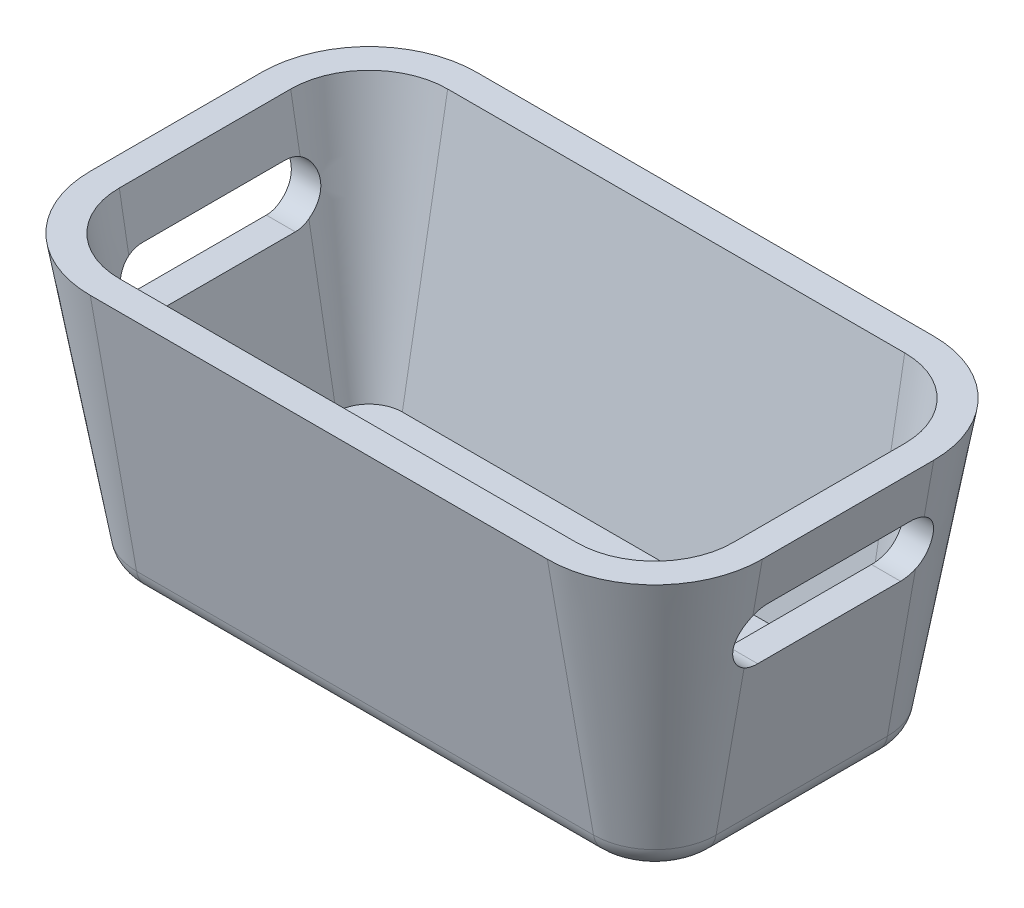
ISO-10303-21;
HEADER;
FILE_DESCRIPTION(('STEP AP214'),'2;1');
FILE_NAME('part.step','',(''),(''),'','','');
FILE_SCHEMA(('AUTOMOTIVE_DESIGN { 1 0 10303 214 1 1 1 1 }'));
ENDSEC;
DATA;
#1=APPLICATION_CONTEXT('core data for automotive mechanical design processes');
#2=APPLICATION_PROTOCOL_DEFINITION('international standard','automotive_design',2000,#1);
#3=PRODUCT_CONTEXT('',#1,'mechanical');
#4=PRODUCT('Part','Part','',(#3));
#5=PRODUCT_RELATED_PRODUCT_CATEGORY('part','',(#4));
#6=PRODUCT_DEFINITION_FORMATION('','',#4);
#7=PRODUCT_DEFINITION_CONTEXT('part definition',#1,'design');
#8=PRODUCT_DEFINITION('design','',#6,#7);
#9=PRODUCT_DEFINITION_SHAPE('','',#8);
#10=(LENGTH_UNIT() NAMED_UNIT(*) SI_UNIT(.MILLI.,.METRE.));
#11=(NAMED_UNIT(*) PLANE_ANGLE_UNIT() SI_UNIT($,.RADIAN.));
#12=(NAMED_UNIT(*) SI_UNIT($,.STERADIAN.) SOLID_ANGLE_UNIT());
#13=UNCERTAINTY_MEASURE_WITH_UNIT(LENGTH_MEASURE(1.E-05),#10,'distance_accuracy_value','');
#14=(GEOMETRIC_REPRESENTATION_CONTEXT(3) GLOBAL_UNCERTAINTY_ASSIGNED_CONTEXT((#13)) GLOBAL_UNIT_ASSIGNED_CONTEXT((#10,
#11,#12)) REPRESENTATION_CONTEXT('',''));
#15=CARTESIAN_POINT('',(0.,0.,0.));
#16=DIRECTION('',(0.,0.,1.));
#17=DIRECTION('',(1.,0.,0.));
#18=AXIS2_PLACEMENT_3D('',#15,#16,#17);
#19=CARTESIAN_POINT('',(-200.,0.,-59.9999999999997));
#20=DIRECTION('',(-0.984807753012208,-0.173648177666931,0.));
#21=DIRECTION('',(0.173648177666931,-0.984807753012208,0.));
#22=AXIS2_PLACEMENT_3D('',#19,#20,#21);
#23=PLANE('',#22);
#24=DIRECTION('',(0.,0.,-1.));
#25=VECTOR('',#24,1.);
#26=CARTESIAN_POINT('',(-229.093951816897,165.,-59.9999999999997));
#27=LINE('',#26,#25);
#28=CARTESIAN_POINT('',(-229.093951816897,165.,-50.));
#29=VERTEX_POINT('',#28);
#30=CARTESIAN_POINT('',(-229.093951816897,165.,50.));
#31=VERTEX_POINT('',#30);
#32=EDGE_CURVE('E460',#29,#31,#27,.F.);
#33=ORIENTED_EDGE('',*,*,#32,.T.);
#34=CARTESIAN_POINT('',(-225.567412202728,145.,50.));
#35=DIRECTION('',(-0.984807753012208,-0.173648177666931,0.));
#36=DIRECTION('',(0.173648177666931,-0.984807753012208,0.));
#37=AXIS2_PLACEMENT_3D('',#34,#35,#36);
#38=ELLIPSE('',#37,20.3085322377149,20.);
#39=CARTESIAN_POINT('',(-228.62148509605,162.320508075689,59.9999999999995));
#40=VERTEX_POINT('',#39);
#41=EDGE_CURVE('E496',#31,#40,#38,.F.);
#42=ORIENTED_EDGE('',*,*,#41,.T.);
#43=DIRECTION('',(-0.173648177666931,0.984807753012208,0.));
#44=VECTOR('',#43,1.);
#45=CARTESIAN_POINT('',(-200.,0.,59.9999999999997));
#46=LINE('',#45,#44);
#47=CARTESIAN_POINT('',(-235.265396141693,200.,59.9999999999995));
#48=VERTEX_POINT('',#47);
#49=EDGE_CURVE('E547',#48,#40,#46,.F.);
#50=ORIENTED_EDGE('',*,*,#49,.F.);
#51=DIRECTION('',(0.,0.,-1.));
#52=VECTOR('',#51,1.);
#53=CARTESIAN_POINT('',(-235.265396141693,200.,-60.0000000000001));
#54=LINE('',#53,#52);
#55=CARTESIAN_POINT('',(-235.265396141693,200.,-59.9999999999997));
#56=VERTEX_POINT('',#55);
#57=EDGE_CURVE('E517',#56,#48,#54,.F.);
#58=ORIENTED_EDGE('',*,*,#57,.F.);
#59=DIRECTION('',(-0.173648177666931,0.984807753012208,0.));
#60=VECTOR('',#59,1.);
#61=CARTESIAN_POINT('',(-200.,0.,-59.9999999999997));
#62=LINE('',#61,#60);
#63=CARTESIAN_POINT('',(-228.62148509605,162.320508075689,-59.9999999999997));
#64=VERTEX_POINT('',#63);
#65=EDGE_CURVE('E551',#56,#64,#62,.F.);
#66=ORIENTED_EDGE('',*,*,#65,.T.);
#67=CARTESIAN_POINT('',(-225.567412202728,145.,-50.));
#68=DIRECTION('',(-0.984807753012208,-0.173648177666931,0.));
#69=DIRECTION('',(0.173648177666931,-0.984807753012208,0.));
#70=AXIS2_PLACEMENT_3D('',#67,#68,#69);
#71=ELLIPSE('',#70,20.3085322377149,20.);
#72=EDGE_CURVE('E280',#64,#29,#71,.F.);
#73=ORIENTED_EDGE('',*,*,#72,.T.);
#74=EDGE_LOOP('',(#33,#42,#50,#58,#66,#73));
#75=FACE_BOUND('',#74,.T.);
#76=ADVANCED_FACE('F34',(#75),#23,.T.);
#77=CARTESIAN_POINT('',(200.,0.,-59.9999999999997));
#78=DIRECTION('',(0.984807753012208,-0.173648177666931,0.));
#79=DIRECTION('',(0.173648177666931,0.984807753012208,0.));
#80=AXIS2_PLACEMENT_3D('',#77,#78,#79);
#81=PLANE('',#80);
#82=DIRECTION('',(0.173648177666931,0.984807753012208,0.));
#83=VECTOR('',#82,1.);
#84=CARTESIAN_POINT('',(200.,0.,59.9999999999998));
#85=LINE('',#84,#83);
#86=CARTESIAN_POINT('',(235.265396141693,200.,59.9999999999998));
#87=VERTEX_POINT('',#86);
#88=CARTESIAN_POINT('',(228.62148509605,162.320508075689,59.9999999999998));
#89=VERTEX_POINT('',#88);
#90=EDGE_CURVE('E537',#87,#89,#85,.F.);
#91=ORIENTED_EDGE('',*,*,#90,.T.);
#92=CARTESIAN_POINT('',(225.567412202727,145.,50.));
#93=DIRECTION('',(0.984807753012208,-0.173648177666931,0.));
#94=DIRECTION('',(0.173648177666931,0.984807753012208,0.));
#95=AXIS2_PLACEMENT_3D('',#92,#93,#94);
#96=ELLIPSE('',#95,20.3085322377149,20.);
#97=CARTESIAN_POINT('',(229.093951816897,165.,50.));
#98=VERTEX_POINT('',#97);
#99=EDGE_CURVE('E367',#89,#98,#96,.F.);
#100=ORIENTED_EDGE('',*,*,#99,.T.);
#101=DIRECTION('',(0.,0.,1.));
#102=VECTOR('',#101,1.);
#103=CARTESIAN_POINT('',(229.093951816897,165.,-59.9999999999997));
#104=LINE('',#103,#102);
#105=CARTESIAN_POINT('',(229.093951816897,165.,-50.));
#106=VERTEX_POINT('',#105);
#107=EDGE_CURVE('E458',#98,#106,#104,.F.);
#108=ORIENTED_EDGE('',*,*,#107,.T.);
#109=CARTESIAN_POINT('',(225.567412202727,145.,-50.));
#110=DIRECTION('',(0.984807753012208,-0.173648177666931,0.));
#111=DIRECTION('',(0.173648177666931,0.984807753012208,0.));
#112=AXIS2_PLACEMENT_3D('',#109,#110,#111);
#113=ELLIPSE('',#112,20.3085322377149,20.);
#114=CARTESIAN_POINT('',(228.62148509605,162.320508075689,-59.9999999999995));
#115=VERTEX_POINT('',#114);
#116=EDGE_CURVE('E334',#106,#115,#113,.F.);
#117=ORIENTED_EDGE('',*,*,#116,.T.);
#118=DIRECTION('',(0.173648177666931,0.984807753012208,0.));
#119=VECTOR('',#118,1.);
#120=CARTESIAN_POINT('',(200.,0.,-59.9999999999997));
#121=LINE('',#120,#119);
#122=CARTESIAN_POINT('',(235.265396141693,200.,-59.9999999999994));
#123=VERTEX_POINT('',#122);
#124=EDGE_CURVE('E533',#123,#115,#121,.F.);
#125=ORIENTED_EDGE('',*,*,#124,.F.);
#126=DIRECTION('',(0.,0.,1.));
#127=VECTOR('',#126,1.);
#128=CARTESIAN_POINT('',(235.265396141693,200.,-60.));
#129=LINE('',#128,#127);
#130=EDGE_CURVE('E525',#87,#123,#129,.F.);
#131=ORIENTED_EDGE('',*,*,#130,.F.);
#132=EDGE_LOOP('',(#91,#100,#108,#117,#125,#131));
#133=FACE_BOUND('',#132,.T.);
#134=ADVANCED_FACE('F351',(#133),#81,.T.);
#135=CARTESIAN_POINT('',(-180.303844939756,3.47296355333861,-59.9999999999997));
#136=DIRECTION('',(-0.984807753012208,-0.173648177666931,0.));
#137=DIRECTION('',(0.173648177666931,-0.984807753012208,0.));
#138=AXIS2_PLACEMENT_3D('',#135,#136,#137);
#139=PLANE('',#138);
#140=CARTESIAN_POINT('',(-205.258879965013,145.,50.));
#141=DIRECTION('',(-0.984807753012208,-0.173648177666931,0.));
#142=DIRECTION('',(0.173648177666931,-0.984807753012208,0.));
#143=AXIS2_PLACEMENT_3D('',#140,#141,#142);
#144=ELLIPSE('',#143,20.3085322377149,20.);
#145=CARTESIAN_POINT('',(-208.785419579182,165.,50.));
#146=VERTEX_POINT('',#145);
#147=CARTESIAN_POINT('',(-208.312952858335,162.320508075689,59.9999999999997));
#148=VERTEX_POINT('',#147);
#149=EDGE_CURVE('E731',#146,#148,#144,.F.);
#150=ORIENTED_EDGE('',*,*,#149,.F.);
#151=DIRECTION('',(0.,0.,-1.));
#152=VECTOR('',#151,1.);
#153=CARTESIAN_POINT('',(-208.785419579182,165.,-59.9999999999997));
#154=LINE('',#153,#152);
#155=CARTESIAN_POINT('',(-208.785419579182,165.,-50.));
#156=VERTEX_POINT('',#155);
#157=EDGE_CURVE('E278',#156,#146,#154,.F.);
#158=ORIENTED_EDGE('',*,*,#157,.F.);
#159=CARTESIAN_POINT('',(-205.258879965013,145.,-50.));
#160=DIRECTION('',(-0.984807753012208,-0.173648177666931,0.));
#161=DIRECTION('',(0.173648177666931,-0.984807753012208,0.));
#162=AXIS2_PLACEMENT_3D('',#159,#160,#161);
#163=ELLIPSE('',#162,20.3085322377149,20.);
#164=CARTESIAN_POINT('',(-208.312952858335,162.320508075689,-59.9999999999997));
#165=VERTEX_POINT('',#164);
#166=EDGE_CURVE('E295',#165,#156,#163,.F.);
#167=ORIENTED_EDGE('',*,*,#166,.F.);
#168=DIRECTION('',(0.173648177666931,-0.984807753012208,0.));
#169=VECTOR('',#168,1.);
#170=CARTESIAN_POINT('',(-180.303844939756,3.47296355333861,-59.9999999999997));
#171=LINE('',#170,#169);
#172=CARTESIAN_POINT('',(-214.956863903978,200.,-59.9999999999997));
#173=VERTEX_POINT('',#172);
#174=EDGE_CURVE('E647',#173,#165,#171,.T.);
#175=ORIENTED_EDGE('',*,*,#174,.F.);
#176=DIRECTION('',(0.,0.,-1.));
#177=VECTOR('',#176,1.);
#178=CARTESIAN_POINT('',(-214.956863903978,200.,-60.0000000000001));
#179=LINE('',#178,#177);
#180=CARTESIAN_POINT('',(-214.956863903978,200.,59.9999999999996));
#181=VERTEX_POINT('',#180);
#182=EDGE_CURVE('E500',#173,#181,#179,.F.);
#183=ORIENTED_EDGE('',*,*,#182,.T.);
#184=DIRECTION('',(-0.173648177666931,0.984807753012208,0.));
#185=VECTOR('',#184,1.);
#186=CARTESIAN_POINT('',(-180.303844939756,3.47296355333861,59.9999999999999));
#187=LINE('',#186,#185);
#188=EDGE_CURVE('E656',#181,#148,#187,.F.);
#189=ORIENTED_EDGE('',*,*,#188,.T.);
#190=EDGE_LOOP('',(#150,#158,#167,#175,#183,#189));
#191=FACE_BOUND('',#190,.T.);
#192=ADVANCED_FACE('F424',(#191),#139,.F.);
#193=CARTESIAN_POINT('',(180.303844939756,3.47296355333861,-59.9999999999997));
#194=DIRECTION('',(0.984807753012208,-0.173648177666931,0.));
#195=DIRECTION('',(0.173648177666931,0.984807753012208,0.));
#196=AXIS2_PLACEMENT_3D('',#193,#194,#195);
#197=PLANE('',#196);
#198=CARTESIAN_POINT('',(205.258879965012,145.,50.));
#199=DIRECTION('',(0.984807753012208,-0.173648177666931,0.));
#200=DIRECTION('',(0.173648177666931,0.984807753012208,0.));
#201=AXIS2_PLACEMENT_3D('',#198,#199,#200);
#202=ELLIPSE('',#201,20.3085322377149,20.);
#203=CARTESIAN_POINT('',(208.312952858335,162.320508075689,59.9999999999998));
#204=VERTEX_POINT('',#203);
#205=CARTESIAN_POINT('',(208.785419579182,165.,50.));
#206=VERTEX_POINT('',#205);
#207=EDGE_CURVE('E11',#204,#206,#202,.F.);
#208=ORIENTED_EDGE('',*,*,#207,.F.);
#209=DIRECTION('',(0.173648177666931,0.984807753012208,0.));
#210=VECTOR('',#209,1.);
#211=CARTESIAN_POINT('',(180.303844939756,3.47296355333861,59.9999999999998));
#212=LINE('',#211,#210);
#213=CARTESIAN_POINT('',(214.956863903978,200.,59.9999999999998));
#214=VERTEX_POINT('',#213);
#215=EDGE_CURVE('E472',#214,#204,#212,.F.);
#216=ORIENTED_EDGE('',*,*,#215,.F.);
#217=DIRECTION('',(0.,0.,1.));
#218=VECTOR('',#217,1.);
#219=CARTESIAN_POINT('',(214.956863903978,200.,-60.));
#220=LINE('',#219,#218);
#221=CARTESIAN_POINT('',(214.956863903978,200.,-59.9999999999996));
#222=VERTEX_POINT('',#221);
#223=EDGE_CURVE('E507',#214,#222,#220,.F.);
#224=ORIENTED_EDGE('',*,*,#223,.T.);
#225=DIRECTION('',(0.173648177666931,0.984807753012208,0.));
#226=VECTOR('',#225,1.);
#227=CARTESIAN_POINT('',(180.303844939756,3.47296355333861,-59.9999999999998));
#228=LINE('',#227,#226);
#229=CARTESIAN_POINT('',(208.312952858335,162.320508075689,-59.9999999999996));
#230=VERTEX_POINT('',#229);
#231=EDGE_CURVE('E485',#222,#230,#228,.F.);
#232=ORIENTED_EDGE('',*,*,#231,.T.);
#233=CARTESIAN_POINT('',(205.258879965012,145.,-50.));
#234=DIRECTION('',(0.984807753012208,-0.173648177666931,0.));
#235=DIRECTION('',(0.173648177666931,0.984807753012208,0.));
#236=AXIS2_PLACEMENT_3D('',#233,#234,#235);
#237=ELLIPSE('',#236,20.3085322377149,20.);
#238=CARTESIAN_POINT('',(208.785419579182,165.,-50.));
#239=VERTEX_POINT('',#238);
#240=EDGE_CURVE('E619',#239,#230,#237,.F.);
#241=ORIENTED_EDGE('',*,*,#240,.F.);
#242=DIRECTION('',(0.,0.,1.));
#243=VECTOR('',#242,1.);
#244=CARTESIAN_POINT('',(208.785419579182,165.,-59.9999999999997));
#245=LINE('',#244,#243);
#246=EDGE_CURVE('E38',#206,#239,#245,.F.);
#247=ORIENTED_EDGE('',*,*,#246,.F.);
#248=EDGE_LOOP('',(#208,#216,#224,#232,#241,#247));
#249=FACE_BOUND('',#248,.T.);
#250=ADVANCED_FACE('F415',(#249),#197,.F.);
#251=CARTESIAN_POINT('',(160.,200.,-60.));
#252=DIRECTION('',(0.,-1.,0.));
#253=DIRECTION('',(0.,0.,-1.));
#254=AXIS2_PLACEMENT_3D('',#251,#252,#253);
#255=PLANE('',#254);
#256=CARTESIAN_POINT('',(160.,200.,-60.));
#257=DIRECTION('',(0.,-1.,0.));
#258=DIRECTION('',(0.,0.,-1.));
#259=AXIS2_PLACEMENT_3D('',#256,#257,#258);
#260=CIRCLE('',#259,75.2653961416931);
#261=CARTESIAN_POINT('',(160.,200.,-135.265396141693));
#262=VERTEX_POINT('',#261);
#263=EDGE_CURVE('E510',#123,#262,#260,.F.);
#264=ORIENTED_EDGE('',*,*,#263,.T.);
#265=DIRECTION('',(1.,0.,0.));
#266=VECTOR('',#265,1.);
#267=CARTESIAN_POINT('',(160.,200.,-135.265396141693));
#268=LINE('',#267,#266);
#269=CARTESIAN_POINT('',(-160.,200.,-135.265396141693));
#270=VERTEX_POINT('',#269);
#271=EDGE_CURVE('E512',#262,#270,#268,.F.);
#272=ORIENTED_EDGE('',*,*,#271,.T.);
#273=CARTESIAN_POINT('',(-160.,200.,-60.));
#274=DIRECTION('',(0.,-1.,0.));
#275=DIRECTION('',(0.,0.,-1.));
#276=AXIS2_PLACEMENT_3D('',#273,#274,#275);
#277=CIRCLE('',#276,75.2653961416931);
#278=EDGE_CURVE('E515',#270,#56,#277,.F.);
#279=ORIENTED_EDGE('',*,*,#278,.T.);
#280=ORIENTED_EDGE('',*,*,#57,.T.);
#281=CARTESIAN_POINT('',(-160.,200.,60.));
#282=DIRECTION('',(0.,-1.,0.));
#283=DIRECTION('',(0.,0.,-1.));
#284=AXIS2_PLACEMENT_3D('',#281,#282,#283);
#285=CIRCLE('',#284,75.2653961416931);
#286=CARTESIAN_POINT('',(-160.,200.,135.265396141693));
#287=VERTEX_POINT('',#286);
#288=EDGE_CURVE('E519',#48,#287,#285,.F.);
#289=ORIENTED_EDGE('',*,*,#288,.T.);
#290=DIRECTION('',(-1.,0.,0.));
#291=VECTOR('',#290,1.);
#292=CARTESIAN_POINT('',(160.,200.,135.265396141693));
#293=LINE('',#292,#291);
#294=CARTESIAN_POINT('',(159.999999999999,200.,135.265396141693));
#295=VERTEX_POINT('',#294);
#296=EDGE_CURVE('E521',#287,#295,#293,.F.);
#297=ORIENTED_EDGE('',*,*,#296,.T.);
#298=CARTESIAN_POINT('',(160.,200.,60.));
#299=DIRECTION('',(0.,-1.,0.));
#300=DIRECTION('',(0.,0.,-1.));
#301=AXIS2_PLACEMENT_3D('',#298,#299,#300);
#302=CIRCLE('',#301,75.2653961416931);
#303=EDGE_CURVE('E523',#295,#87,#302,.F.);
#304=ORIENTED_EDGE('',*,*,#303,.T.);
#305=ORIENTED_EDGE('',*,*,#130,.T.);
#306=EDGE_LOOP('',(#264,#272,#279,#280,#289,#297,#304,#305));
#307=FACE_BOUND('',#306,.T.);
#308=CARTESIAN_POINT('',(160.,200.,-60.));
#309=DIRECTION('',(0.,-1.,0.));
#310=DIRECTION('',(0.,0.,-1.));
#311=AXIS2_PLACEMENT_3D('',#308,#309,#310);
#312=CIRCLE('',#311,54.9568639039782);
#313=CARTESIAN_POINT('',(160.,200.,-114.956863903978));
#314=VERTEX_POINT('',#313);
#315=EDGE_CURVE('E493',#222,#314,#312,.F.);
#316=ORIENTED_EDGE('',*,*,#315,.F.);
#317=ORIENTED_EDGE('',*,*,#223,.F.);
#318=CARTESIAN_POINT('',(160.,200.,60.));
#319=DIRECTION('',(0.,-1.,0.));
#320=DIRECTION('',(0.,0.,-1.));
#321=AXIS2_PLACEMENT_3D('',#318,#319,#320);
#322=CIRCLE('',#321,54.9568639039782);
#323=CARTESIAN_POINT('',(160.,200.,114.956863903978));
#324=VERTEX_POINT('',#323);
#325=EDGE_CURVE('E477',#324,#214,#322,.F.);
#326=ORIENTED_EDGE('',*,*,#325,.F.);
#327=DIRECTION('',(-1.,0.,0.));
#328=VECTOR('',#327,1.);
#329=CARTESIAN_POINT('',(160.,200.,114.956863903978));
#330=LINE('',#329,#328);
#331=CARTESIAN_POINT('',(-160.,200.,114.956863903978));
#332=VERTEX_POINT('',#331);
#333=EDGE_CURVE('E504',#332,#324,#330,.F.);
#334=ORIENTED_EDGE('',*,*,#333,.F.);
#335=CARTESIAN_POINT('',(-160.,200.,60.));
#336=DIRECTION('',(0.,-1.,0.));
#337=DIRECTION('',(0.,0.,-1.));
#338=AXIS2_PLACEMENT_3D('',#335,#336,#337);
#339=CIRCLE('',#338,54.9568639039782);
#340=EDGE_CURVE('E502',#181,#332,#339,.F.);
#341=ORIENTED_EDGE('',*,*,#340,.F.);
#342=ORIENTED_EDGE('',*,*,#182,.F.);
#343=CARTESIAN_POINT('',(-160.,200.,-60.));
#344=DIRECTION('',(0.,-1.,0.));
#345=DIRECTION('',(0.,0.,-1.));
#346=AXIS2_PLACEMENT_3D('',#343,#344,#345);
#347=CIRCLE('',#346,54.9568639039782);
#348=CARTESIAN_POINT('',(-160.,200.,-114.956863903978));
#349=VERTEX_POINT('',#348);
#350=EDGE_CURVE('E498',#349,#173,#347,.F.);
#351=ORIENTED_EDGE('',*,*,#350,.F.);
#352=DIRECTION('',(1.,0.,0.));
#353=VECTOR('',#352,1.);
#354=CARTESIAN_POINT('',(160.,200.,-114.956863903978));
#355=LINE('',#354,#353);
#356=EDGE_CURVE('E495',#314,#349,#355,.F.);
#357=ORIENTED_EDGE('',*,*,#356,.F.);
#358=EDGE_LOOP('',(#316,#317,#326,#334,#341,#342,#351,#357));
#359=FACE_BOUND('',#358,.T.);
#360=ADVANCED_FACE('F342',(#307,#359),#255,.F.);
#361=CARTESIAN_POINT('',(160.,0.,-60.));
#362=DIRECTION('',(0.,1.,0.));
#363=DIRECTION('',(0.,0.,-1.));
#364=AXIS2_PLACEMENT_3D('',#361,#362,#363);
#365=CONICAL_SURFACE('',#364,40.,0.174532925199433);
#366=ORIENTED_EDGE('',*,*,#124,.T.);
#367=CARTESIAN_POINT('',(228.621505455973,162.320623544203,-59.9997999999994));
#368=CARTESIAN_POINT('',(228.596804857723,162.180530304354,-60.2424558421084));
#369=CARTESIAN_POINT('',(228.569936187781,162.035452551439,-60.4819655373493));
#370=CARTESIAN_POINT('',(228.512115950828,161.735623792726,-60.9543215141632));
#371=CARTESIAN_POINT('',(228.481164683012,161.580873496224,-61.1871682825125));
#372=CARTESIAN_POINT('',(228.382602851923,161.102729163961,-61.8749172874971));
#373=CARTESIAN_POINT('',(228.309252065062,160.765262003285,-62.3193390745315));
#374=CARTESIAN_POINT('',(228.149706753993,160.05666902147,-63.175926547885));
#375=CARTESIAN_POINT('',(228.063545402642,159.685631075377,-63.5881714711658));
#376=CARTESIAN_POINT('',(227.88051602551,158.911912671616,-64.3793184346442));
#377=CARTESIAN_POINT('',(227.78364699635,158.509229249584,-64.758217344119));
#378=CARTESIAN_POINT('',(227.581665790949,157.675720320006,-65.4799773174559));
#379=CARTESIAN_POINT('',(227.476564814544,157.244933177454,-65.8228859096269));
#380=CARTESIAN_POINT('',(227.260262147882,156.357526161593,-66.4714466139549));
#381=CARTESIAN_POINT('',(227.149060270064,155.900905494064,-66.77709757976));
#382=CARTESIAN_POINT('',(226.979337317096,155.198779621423,-67.2064023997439));
#383=CARTESIAN_POINT('',(226.922250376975,154.961763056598,-67.344696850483));
#384=CARTESIAN_POINT('',(226.807385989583,154.48243408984,-67.6113211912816));
#385=CARTESIAN_POINT('',(226.749608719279,154.240123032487,-67.7396535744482));
#386=CARTESIAN_POINT('',(226.575600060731,153.505653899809,-68.109508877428));
#387=CARTESIAN_POINT('',(226.458686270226,153.005937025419,-68.3359039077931));
#388=CARTESIAN_POINT('',(226.220485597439,151.969585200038,-68.7549872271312));
#389=CARTESIAN_POINT('',(226.099207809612,151.432271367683,-68.9459970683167));
#390=CARTESIAN_POINT('',(225.858927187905,150.342803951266,-69.2815793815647));
#391=CARTESIAN_POINT('',(225.739924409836,149.790650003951,-69.4261507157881));
#392=CARTESIAN_POINT('',(225.50602742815,148.675192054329,-69.667704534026));
#393=CARTESIAN_POINT('',(225.391133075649,148.111888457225,-69.7646887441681));
#394=CARTESIAN_POINT('',(225.167006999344,146.977935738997,-69.9101608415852));
#395=CARTESIAN_POINT('',(225.057775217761,146.4072866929,-69.958649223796));
#396=CARTESIAN_POINT('',(224.845985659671,145.261356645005,-70.0065310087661));
#397=CARTESIAN_POINT('',(224.743443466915,144.686068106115,-70.0058136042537));
#398=CARTESIAN_POINT('',(224.546210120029,143.536342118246,-69.9546690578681));
#399=CARTESIAN_POINT('',(224.45151901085,142.961904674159,-69.9042416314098));
#400=CARTESIAN_POINT('',(224.270529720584,141.818360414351,-69.7537256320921));
#401=CARTESIAN_POINT('',(224.184229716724,141.249252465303,-69.6536478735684));
#402=CARTESIAN_POINT('',(224.020114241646,140.120681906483,-69.4042830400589));
#403=CARTESIAN_POINT('',(223.942298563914,139.56121906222,-69.2549971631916));
#404=CARTESIAN_POINT('',(223.796732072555,138.470476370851,-68.9125270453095));
#405=CARTESIAN_POINT('',(223.728775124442,137.938841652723,-68.7205599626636));
#406=CARTESIAN_POINT('',(223.599992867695,136.893015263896,-68.2919708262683));
#407=CARTESIAN_POINT('',(223.539167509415,136.378823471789,-68.0553490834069));
#408=CARTESIAN_POINT('',(223.423651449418,135.371518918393,-67.5388919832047));
#409=CARTESIAN_POINT('',(223.368963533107,134.878415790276,-67.2590371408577));
#410=CARTESIAN_POINT('',(223.290643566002,134.157794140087,-66.8085366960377));
#411=CARTESIAN_POINT('',(223.265154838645,133.9207521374,-66.6532449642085));
#412=CARTESIAN_POINT('',(223.215222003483,133.45334172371,-66.3326364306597));
#413=CARTESIAN_POINT('',(223.190778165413,133.222975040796,-66.1673170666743));
#414=CARTESIAN_POINT('',(223.119134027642,132.546304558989,-65.6595561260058));
#415=CARTESIAN_POINT('',(223.073198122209,132.110468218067,-65.3028326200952));
#416=CARTESIAN_POINT('',(222.983175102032,131.270336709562,-64.553799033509));
#417=CARTESIAN_POINT('',(222.939087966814,130.866041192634,-64.1614893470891));
#418=CARTESIAN_POINT('',(222.873156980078,130.285861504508,-63.5489160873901));
#419=CARTESIAN_POINT('',(222.851228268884,130.096966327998,-63.3408580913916));
#420=CARTESIAN_POINT('',(222.807224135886,129.728159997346,-62.9170359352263));
#421=CARTESIAN_POINT('',(222.785148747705,129.548246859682,-62.7012734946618));
#422=CARTESIAN_POINT('',(222.718406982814,129.02256626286,-62.0431131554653));
#423=CARTESIAN_POINT('',(222.673195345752,128.690590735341,-61.5895603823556));
#424=CARTESIAN_POINT('',(222.608153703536,128.255679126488,-60.9396775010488));
#425=CARTESIAN_POINT('',(222.589564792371,128.135970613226,-60.7542205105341));
#426=CARTESIAN_POINT('',(222.55186281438,127.902922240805,-60.37971432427));
#427=CARTESIAN_POINT('',(222.532750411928,127.789574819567,-60.1906697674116));
#428=CARTESIAN_POINT('',(222.51331894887,127.679376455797,-59.9997999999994));
#429=B_SPLINE_CURVE_WITH_KNOTS('',3,(#367,#368,#369,#370,#371,#372,#373,#374,#375,#376,#377,
#378,#379,#380,#381,#382,#383,#384,#385,#386,#387,#388,#389,#390,#391,#392,#393,#394,#395,#396,
#397,#398,#399,#400,#401,#402,#403,#404,#405,#406,#407,#408,#409,#410,#411,#412,#413,#414,#415,
#416,#417,#418,#419,#420,#421,#422,#423,#424,#425,#426,#427,#428),.UNSPECIFIED.,.F.,.F.,(4,2,2,
2,2,2,2,2,2,2,2,2,2,2,2,2,2,2,2,2,2,2,2,2,2,2,2,2,2,2,4),(0.,0.843688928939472,1.68731606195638,
3.3734926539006,5.05537659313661,6.73741826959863,8.41720995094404,10.0970533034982,
10.9377200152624,11.7781756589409,13.4590051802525,15.2060253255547,16.9530882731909,
18.700087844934,20.4470695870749,22.1979855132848,23.9489114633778,25.699456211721,
27.449958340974,29.1557996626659,30.8616291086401,32.5682296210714,33.4215820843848,
34.2751535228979,35.9682639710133,37.661355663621,38.506740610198,39.3519380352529,
41.0411684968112,41.7056339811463,42.369292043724),.UNSPECIFIED.);
#430=CARTESIAN_POINT('',(222.513339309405,127.679491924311,-59.9999999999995));
#431=VERTEX_POINT('',#430);
#432=EDGE_CURVE('E328',#115,#431,#429,.T.);
#433=ORIENTED_EDGE('',*,*,#432,.T.);
#434=CARTESIAN_POINT('',(202.914162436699,16.5270364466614,-59.9999999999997));
#435=VERTEX_POINT('',#434);
#436=EDGE_CURVE('E527',#431,#435,#121,.F.);
#437=ORIENTED_EDGE('',*,*,#436,.T.);
#438=CARTESIAN_POINT('',(160.,16.5270364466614,-60.));
#439=DIRECTION('',(0.,1.,0.));
#440=DIRECTION('',(0.,0.,1.));
#441=AXIS2_PLACEMENT_3D('',#438,#439,#440);
#442=CIRCLE('',#441,42.9141624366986);
#443=CARTESIAN_POINT('',(160.,16.5270364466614,-102.914162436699));
#444=VERTEX_POINT('',#443);
#445=EDGE_CURVE('E591',#435,#444,#442,.T.);
#446=ORIENTED_EDGE('',*,*,#445,.T.);
#447=DIRECTION('',(0.,0.984807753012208,-0.173648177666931));
#448=VECTOR('',#447,1.);
#449=CARTESIAN_POINT('',(160.,0.,-100.));
#450=LINE('',#449,#448);
#451=EDGE_CURVE('E528',#262,#444,#450,.F.);
#452=ORIENTED_EDGE('',*,*,#451,.F.);
#453=ORIENTED_EDGE('',*,*,#263,.F.);
#454=EDGE_LOOP('',(#366,#433,#437,#446,#452,#453));
#455=FACE_BOUND('',#454,.T.);
#456=ADVANCED_FACE('F336',(#455),#365,.T.);
#457=CARTESIAN_POINT('',(-160.,0.,-100.));
#458=DIRECTION('',(0.,-0.173648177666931,-0.984807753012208));
#459=DIRECTION('',(0.,0.984807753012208,-0.173648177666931));
#460=AXIS2_PLACEMENT_3D('',#457,#458,#459);
#461=PLANE('',#460);
#462=ORIENTED_EDGE('',*,*,#451,.T.);
#463=DIRECTION('',(-1.,0.,0.));
#464=VECTOR('',#463,1.);
#465=CARTESIAN_POINT('',(-160.,16.5270364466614,-102.914162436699));
#466=LINE('',#465,#464);
#467=CARTESIAN_POINT('',(-160.,16.5270364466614,-102.914162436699));
#468=VERTEX_POINT('',#467);
#469=EDGE_CURVE('E531',#444,#468,#466,.T.);
#470=ORIENTED_EDGE('',*,*,#469,.T.);
#471=DIRECTION('',(0.,0.984807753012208,-0.173648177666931));
#472=VECTOR('',#471,1.);
#473=CARTESIAN_POINT('',(-160.,0.,-100.));
#474=LINE('',#473,#472);
#475=EDGE_CURVE('E532',#270,#468,#474,.F.);
#476=ORIENTED_EDGE('',*,*,#475,.F.);
#477=ORIENTED_EDGE('',*,*,#271,.F.);
#478=EDGE_LOOP('',(#462,#470,#476,#477));
#479=FACE_BOUND('',#478,.T.);
#480=ADVANCED_FACE('F341',(#479),#461,.T.);
#481=CARTESIAN_POINT('',(-160.,0.,-60.));
#482=DIRECTION('',(0.,1.,0.));
#483=DIRECTION('',(0.,0.,1.));
#484=AXIS2_PLACEMENT_3D('',#481,#482,#483);
#485=CONICAL_SURFACE('',#484,40.,0.174532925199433);
#486=CARTESIAN_POINT('',(-222.513339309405,127.679491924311,-59.9999999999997));
#487=VERTEX_POINT('',#486);
#488=CARTESIAN_POINT('',(-202.914162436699,16.5270364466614,-59.9999999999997));
#489=VERTEX_POINT('',#488);
#490=EDGE_CURVE('E550',#487,#489,#62,.F.);
#491=ORIENTED_EDGE('',*,*,#490,.F.);
#492=CARTESIAN_POINT('',(-222.51331894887,127.679376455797,-59.9997999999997));
#493=CARTESIAN_POINT('',(-222.53819056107,127.820418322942,-60.2440985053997));
#494=CARTESIAN_POINT('',(-222.562539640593,127.966635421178,-60.4854219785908));
#495=CARTESIAN_POINT('',(-222.610383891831,128.269185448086,-60.9617271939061));
#496=CARTESIAN_POINT('',(-222.633879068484,128.425518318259,-61.1967089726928));
#497=CARTESIAN_POINT('',(-222.703357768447,128.909249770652,-61.8914271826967));
#498=CARTESIAN_POINT('',(-222.748348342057,129.251461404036,-62.3410753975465));
#499=CARTESIAN_POINT('',(-222.837222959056,129.972475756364,-63.2095401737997));
#500=CARTESIAN_POINT('',(-222.881107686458,130.35125511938,-63.6283761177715));
#501=CARTESIAN_POINT('',(-222.969465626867,131.142838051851,-64.4325090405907));
#502=CARTESIAN_POINT('',(-223.013938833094,131.55564122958,-64.817806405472));
#503=CARTESIAN_POINT('',(-223.105140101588,132.41243943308,-65.5522310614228));
#504=CARTESIAN_POINT('',(-223.151869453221,132.856452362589,-65.9013373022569));
#505=CARTESIAN_POINT('',(-223.249115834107,133.772133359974,-66.5605941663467));
#506=CARTESIAN_POINT('',(-223.29963290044,134.243801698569,-66.8707444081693));
#507=CARTESIAN_POINT('',(-223.405830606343,135.211057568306,-67.4497624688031));
#508=CARTESIAN_POINT('',(-223.46150946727,135.706636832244,-67.718644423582));
#509=CARTESIAN_POINT('',(-223.579211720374,136.718100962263,-68.2133769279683));
#510=CARTESIAN_POINT('',(-223.64123505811,137.233985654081,-68.4392278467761));
#511=CARTESIAN_POINT('',(-223.772306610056,138.280527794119,-68.8457648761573));
#512=CARTESIAN_POINT('',(-223.841332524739,138.811134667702,-69.0265883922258));
#513=CARTESIAN_POINT('',(-223.987118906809,139.884661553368,-69.3428653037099));
#514=CARTESIAN_POINT('',(-224.063879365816,140.427581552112,-69.478318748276));
#515=CARTESIAN_POINT('',(-224.225352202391,141.521826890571,-69.7031561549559));
#516=CARTESIAN_POINT('',(-224.310066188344,142.073153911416,-69.792530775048));
#517=CARTESIAN_POINT('',(-224.487273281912,143.18010939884,-69.9248267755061));
#518=CARTESIAN_POINT('',(-224.579766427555,143.735737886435,-69.9677479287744));
#519=CARTESIAN_POINT('',(-224.772292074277,144.84896703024,-70.0072060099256));
#520=CARTESIAN_POINT('',(-224.872345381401,145.406568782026,-70.0036099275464));
#521=CARTESIAN_POINT('',(-225.078900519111,146.518330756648,-69.950047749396));
#522=CARTESIAN_POINT('',(-225.185402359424,147.07249097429,-69.9000815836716));
#523=CARTESIAN_POINT('',(-225.403686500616,148.173689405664,-69.7543959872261));
#524=CARTESIAN_POINT('',(-225.515468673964,148.720727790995,-69.6586776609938));
#525=CARTESIAN_POINT('',(-225.742878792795,149.804200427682,-69.4223356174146));
#526=CARTESIAN_POINT('',(-225.858506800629,150.340634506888,-69.2817111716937));
#527=CARTESIAN_POINT('',(-226.094669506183,151.411954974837,-68.9527864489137));
#528=CARTESIAN_POINT('',(-226.215255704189,151.946511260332,-68.7634473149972));
#529=CARTESIAN_POINT('',(-226.456697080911,152.997587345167,-68.3401093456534));
#530=CARTESIAN_POINT('',(-226.577552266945,153.514106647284,-68.1061092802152));
#531=CARTESIAN_POINT('',(-226.817428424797,154.526157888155,-67.5947150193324));
#532=CARTESIAN_POINT('',(-226.936447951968,155.021673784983,-67.3172883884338));
#533=CARTESIAN_POINT('',(-227.170211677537,155.988031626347,-66.7208120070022));
#534=CARTESIAN_POINT('',(-227.28495603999,156.458874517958,-66.4017638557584));
#535=CARTESIAN_POINT('',(-227.509169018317,157.378642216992,-65.7194573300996));
#536=CARTESIAN_POINT('',(-227.618549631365,157.827202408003,-65.3556780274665));
#537=CARTESIAN_POINT('',(-227.827799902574,158.692494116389,-64.5893665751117));
#538=CARTESIAN_POINT('',(-227.927667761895,159.109219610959,-64.1868271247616));
#539=CARTESIAN_POINT('',(-228.114979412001,159.906461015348,-63.3466121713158));
#540=CARTESIAN_POINT('',(-228.202452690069,160.287062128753,-62.9090240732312));
#541=CARTESIAN_POINT('',(-228.362612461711,161.009781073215,-62.0009660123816));
#542=CARTESIAN_POINT('',(-228.435309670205,161.351926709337,-61.5305202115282));
#543=CARTESIAN_POINT('',(-228.521948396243,161.786447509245,-60.8746138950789));
#544=CARTESIAN_POINT('',(-228.543441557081,161.897026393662,-60.7019901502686));
#545=CARTESIAN_POINT('',(-228.584176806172,162.112830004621,-60.3534050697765));
#546=CARTESIAN_POINT('',(-228.60342109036,162.21805989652,-60.1774471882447));
#547=CARTESIAN_POINT('',(-228.621505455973,162.320623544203,-59.9997999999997));
#548=B_SPLINE_CURVE_WITH_KNOTS('',3,(#492,#493,#494,#495,#496,#497,#498,#499,#500,#501,#502,
#503,#504,#505,#506,#507,#508,#509,#510,#511,#512,#513,#514,#515,#516,#517,#518,#519,#520,#521,
#522,#523,#524,#525,#526,#527,#528,#529,#530,#531,#532,#533,#534,#535,#536,#537,#538,#539,#540,
#541,#542,#543,#544,#545,#546,#547),.UNSPECIFIED.,.F.,.F.,(4,2,2,2,2,2,2,2,2,2,2,2,2,2,2,2,2,2,
2,2,2,2,2,2,2,2,2,4),(0.,0.849419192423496,1.69883347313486,3.39718058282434,5.09445004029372,
6.7916999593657,8.48993159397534,10.1881798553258,11.8858450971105,13.5834957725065,
15.2759006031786,16.9683036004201,18.6610495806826,20.3538038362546,22.0513993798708,
23.7489974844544,25.4465546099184,27.1441392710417,28.8814574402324,30.6188234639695,
32.357493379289,34.0960965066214,35.8573070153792,37.6188499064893,39.376128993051,
41.1321291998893,41.7504297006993,42.3681213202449),.UNSPECIFIED.);
#549=EDGE_CURVE('E274',#487,#64,#548,.T.);
#550=ORIENTED_EDGE('',*,*,#549,.T.);
#551=ORIENTED_EDGE('',*,*,#65,.F.);
#552=ORIENTED_EDGE('',*,*,#278,.F.);
#553=ORIENTED_EDGE('',*,*,#475,.T.);
#554=CARTESIAN_POINT('',(-160.,16.5270364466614,-60.));
#555=DIRECTION('',(0.,1.,0.));
#556=DIRECTION('',(0.,0.,1.));
#557=AXIS2_PLACEMENT_3D('',#554,#555,#556);
#558=CIRCLE('',#557,42.9141624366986);
#559=EDGE_CURVE('E575',#468,#489,#558,.T.);
#560=ORIENTED_EDGE('',*,*,#559,.T.);
#561=EDGE_LOOP('',(#491,#550,#551,#552,#553,#560));
#562=FACE_BOUND('',#561,.T.);
#563=ADVANCED_FACE('F439',(#562),#485,.T.);
#564=CARTESIAN_POINT('',(-222.513339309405,127.679491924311,59.9999999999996));
#565=VERTEX_POINT('',#564);
#566=CARTESIAN_POINT('',(-202.914162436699,16.5270364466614,59.9999999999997));
#567=VERTEX_POINT('',#566);
#568=EDGE_CURVE('E546',#565,#567,#46,.F.);
#569=ORIENTED_EDGE('',*,*,#568,.F.);
#570=CARTESIAN_POINT('',(-222.040872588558,125.,50.));
#571=VERTEX_POINT('',#570);
#572=EDGE_CURVE('E50',#565,#571,#38,.F.);
#573=ORIENTED_EDGE('',*,*,#572,.T.);
#574=DIRECTION('',(0.,0.,1.));
#575=VECTOR('',#574,1.);
#576=CARTESIAN_POINT('',(-222.040872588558,125.,-59.9999999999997));
#577=LINE('',#576,#575);
#578=CARTESIAN_POINT('',(-222.040872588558,125.,-50.));
#579=VERTEX_POINT('',#578);
#580=EDGE_CURVE('E284',#571,#579,#577,.F.);
#581=ORIENTED_EDGE('',*,*,#580,.T.);
#582=EDGE_CURVE('E268',#579,#487,#71,.F.);
#583=ORIENTED_EDGE('',*,*,#582,.T.);
#584=ORIENTED_EDGE('',*,*,#490,.T.);
#585=DIRECTION('',(0.,0.,1.));
#586=VECTOR('',#585,1.);
#587=CARTESIAN_POINT('',(-202.914162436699,16.5270364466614,59.9999999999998));
#588=LINE('',#587,#586);
#589=EDGE_CURVE('E578',#489,#567,#588,.T.);
#590=ORIENTED_EDGE('',*,*,#589,.T.);
#591=EDGE_LOOP('',(#569,#573,#581,#583,#584,#590));
#592=FACE_BOUND('',#591,.T.);
#593=ADVANCED_FACE('F291',(#592),#23,.T.);
#594=CARTESIAN_POINT('',(-160.,0.,60.));
#595=DIRECTION('',(0.,1.,0.));
#596=DIRECTION('',(0.,0.,1.));
#597=AXIS2_PLACEMENT_3D('',#594,#595,#596);
#598=CONICAL_SURFACE('',#597,40.,0.174532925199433);
#599=ORIENTED_EDGE('',*,*,#49,.T.);
#600=CARTESIAN_POINT('',(-228.621505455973,162.320623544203,59.9997999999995));
#601=CARTESIAN_POINT('',(-228.596804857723,162.180530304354,60.2424558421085));
#602=CARTESIAN_POINT('',(-228.569936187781,162.035452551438,60.4819655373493));
#603=CARTESIAN_POINT('',(-228.512115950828,161.735623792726,60.9543215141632));
#604=CARTESIAN_POINT('',(-228.481164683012,161.580873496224,61.1871682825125));
#605=CARTESIAN_POINT('',(-228.382602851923,161.102729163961,61.8749172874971));
#606=CARTESIAN_POINT('',(-228.309252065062,160.765262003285,62.3193390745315));
#607=CARTESIAN_POINT('',(-228.149706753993,160.05666902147,63.1759265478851));
#608=CARTESIAN_POINT('',(-228.063545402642,159.685631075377,63.5881714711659));
#609=CARTESIAN_POINT('',(-227.88051602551,158.911912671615,64.3793184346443));
#610=CARTESIAN_POINT('',(-227.78364699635,158.509229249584,64.758217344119));
#611=CARTESIAN_POINT('',(-227.581665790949,157.675720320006,65.479977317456));
#612=CARTESIAN_POINT('',(-227.476564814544,157.244933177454,65.8228859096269));
#613=CARTESIAN_POINT('',(-227.260262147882,156.357526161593,66.4714466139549));
#614=CARTESIAN_POINT('',(-227.149060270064,155.900905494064,66.77709757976));
#615=CARTESIAN_POINT('',(-226.979337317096,155.198779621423,67.2064023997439));
#616=CARTESIAN_POINT('',(-226.922250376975,154.961763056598,67.344696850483));
#617=CARTESIAN_POINT('',(-226.807385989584,154.48243408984,67.6113211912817));
#618=CARTESIAN_POINT('',(-226.749608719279,154.240123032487,67.7396535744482));
#619=CARTESIAN_POINT('',(-226.575600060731,153.505653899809,68.1095088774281));
#620=CARTESIAN_POINT('',(-226.458686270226,153.005937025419,68.3359039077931));
#621=CARTESIAN_POINT('',(-226.220485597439,151.969585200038,68.7549872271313));
#622=CARTESIAN_POINT('',(-226.099207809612,151.432271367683,68.9459970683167));
#623=CARTESIAN_POINT('',(-225.858927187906,150.342803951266,69.2815793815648));
#624=CARTESIAN_POINT('',(-225.739924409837,149.790650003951,69.4261507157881));
#625=CARTESIAN_POINT('',(-225.506027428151,148.675192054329,69.667704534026));
#626=CARTESIAN_POINT('',(-225.391133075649,148.111888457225,69.7646887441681));
#627=CARTESIAN_POINT('',(-225.167006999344,146.977935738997,69.9101608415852));
#628=CARTESIAN_POINT('',(-225.057775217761,146.407286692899,69.958649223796));
#629=CARTESIAN_POINT('',(-224.845985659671,145.261356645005,70.0065310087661));
#630=CARTESIAN_POINT('',(-224.743443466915,144.686068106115,70.0058136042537));
#631=CARTESIAN_POINT('',(-224.54621012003,143.536342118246,69.9546690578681));
#632=CARTESIAN_POINT('',(-224.45151901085,142.961904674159,69.9042416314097));
#633=CARTESIAN_POINT('',(-224.270529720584,141.81836041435,69.753725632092));
#634=CARTESIAN_POINT('',(-224.184229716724,141.249252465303,69.6536478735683));
#635=CARTESIAN_POINT('',(-224.020114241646,140.120681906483,69.4042830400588));
#636=CARTESIAN_POINT('',(-223.942298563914,139.56121906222,69.2549971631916));
#637=CARTESIAN_POINT('',(-223.796732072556,138.470476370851,68.9125270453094));
#638=CARTESIAN_POINT('',(-223.728775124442,137.938841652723,68.7205599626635));
#639=CARTESIAN_POINT('',(-223.599992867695,136.893015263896,68.2919708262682));
#640=CARTESIAN_POINT('',(-223.539167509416,136.378823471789,68.0553490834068));
#641=CARTESIAN_POINT('',(-223.423651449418,135.371518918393,67.5388919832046));
#642=CARTESIAN_POINT('',(-223.368963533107,134.878415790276,67.2590371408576));
#643=CARTESIAN_POINT('',(-223.290643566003,134.157794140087,66.8085366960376));
#644=CARTESIAN_POINT('',(-223.265154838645,133.9207521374,66.6532449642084));
#645=CARTESIAN_POINT('',(-223.215222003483,133.45334172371,66.3326364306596));
#646=CARTESIAN_POINT('',(-223.190778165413,133.222975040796,66.1673170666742));
#647=CARTESIAN_POINT('',(-223.119134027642,132.546304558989,65.6595561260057));
#648=CARTESIAN_POINT('',(-223.073198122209,132.110468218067,65.3028326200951));
#649=CARTESIAN_POINT('',(-222.983175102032,131.270336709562,64.5537990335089));
#650=CARTESIAN_POINT('',(-222.939087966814,130.866041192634,64.161489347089));
#651=CARTESIAN_POINT('',(-222.873156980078,130.285861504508,63.54891608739));
#652=CARTESIAN_POINT('',(-222.851228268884,130.096966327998,63.3408580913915));
#653=CARTESIAN_POINT('',(-222.807224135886,129.728159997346,62.9170359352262));
#654=CARTESIAN_POINT('',(-222.785148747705,129.548246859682,62.7012734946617));
#655=CARTESIAN_POINT('',(-222.718406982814,129.02256626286,62.0431131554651));
#656=CARTESIAN_POINT('',(-222.673195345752,128.690590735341,61.5895603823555));
#657=CARTESIAN_POINT('',(-222.608153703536,128.255679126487,60.9396775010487));
#658=CARTESIAN_POINT('',(-222.589564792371,128.135970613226,60.754220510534));
#659=CARTESIAN_POINT('',(-222.551862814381,127.902922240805,60.37971432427));
#660=CARTESIAN_POINT('',(-222.532750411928,127.789574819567,60.1906697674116));
#661=CARTESIAN_POINT('',(-222.51331894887,127.679376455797,59.9997999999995));
#662=B_SPLINE_CURVE_WITH_KNOTS('',3,(#600,#601,#602,#603,#604,#605,#606,#607,#608,#609,#610,
#611,#612,#613,#614,#615,#616,#617,#618,#619,#620,#621,#622,#623,#624,#625,#626,#627,#628,#629,
#630,#631,#632,#633,#634,#635,#636,#637,#638,#639,#640,#641,#642,#643,#644,#645,#646,#647,#648,
#649,#650,#651,#652,#653,#654,#655,#656,#657,#658,#659,#660,#661),.UNSPECIFIED.,.F.,.F.,(4,2,2,
2,2,2,2,2,2,2,2,2,2,2,2,2,2,2,2,2,2,2,2,2,2,2,2,2,2,2,4),(0.,0.843688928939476,1.68731606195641,
3.37349265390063,5.05537659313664,6.73741826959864,8.41720995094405,10.0970533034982,
10.9377200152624,11.7781756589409,13.4590051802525,15.2060253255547,16.9530882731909,
18.7000878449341,20.4470695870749,22.1979855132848,23.9489114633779,25.6994562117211,
27.449958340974,29.155799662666,30.8616291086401,32.5682296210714,33.4215820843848,
34.2751535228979,35.9682639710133,37.661355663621,38.506740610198,39.3519380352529,
41.0411684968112,41.7056339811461,42.3692920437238),.UNSPECIFIED.);
#663=EDGE_CURVE('E369',#40,#565,#662,.T.);
#664=ORIENTED_EDGE('',*,*,#663,.T.);
#665=ORIENTED_EDGE('',*,*,#568,.T.);
#666=CARTESIAN_POINT('',(-160.,16.5270364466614,60.));
#667=DIRECTION('',(0.,1.,0.));
#668=DIRECTION('',(0.,0.,1.));
#669=AXIS2_PLACEMENT_3D('',#666,#667,#668);
#670=CIRCLE('',#669,42.9141624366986);
#671=CARTESIAN_POINT('',(-160.,16.5270364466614,102.914162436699));
#672=VERTEX_POINT('',#671);
#673=EDGE_CURVE('E581',#567,#672,#670,.T.);
#674=ORIENTED_EDGE('',*,*,#673,.T.);
#675=DIRECTION('',(0.,0.984807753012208,0.173648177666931));
#676=VECTOR('',#675,1.);
#677=CARTESIAN_POINT('',(-160.,0.,100.));
#678=LINE('',#677,#676);
#679=EDGE_CURVE('E543',#287,#672,#678,.F.);
#680=ORIENTED_EDGE('',*,*,#679,.F.);
#681=ORIENTED_EDGE('',*,*,#288,.F.);
#682=EDGE_LOOP('',(#599,#664,#665,#674,#680,#681));
#683=FACE_BOUND('',#682,.T.);
#684=ADVANCED_FACE('F438',(#683),#598,.T.);
#685=CARTESIAN_POINT('',(-160.,0.,100.));
#686=DIRECTION('',(0.,-0.173648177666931,0.984807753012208));
#687=DIRECTION('',(0.,-0.984807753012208,-0.173648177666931));
#688=AXIS2_PLACEMENT_3D('',#685,#686,#687);
#689=PLANE('',#688);
#690=ORIENTED_EDGE('',*,*,#679,.T.);
#691=DIRECTION('',(1.,0.,0.));
#692=VECTOR('',#691,1.);
#693=CARTESIAN_POINT('',(160.,16.5270364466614,102.914162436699));
#694=LINE('',#693,#692);
#695=CARTESIAN_POINT('',(160.,16.5270364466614,102.914162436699));
#696=VERTEX_POINT('',#695);
#697=EDGE_CURVE('E583',#672,#696,#694,.T.);
#698=ORIENTED_EDGE('',*,*,#697,.T.);
#699=DIRECTION('',(0.,0.984807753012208,0.173648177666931));
#700=VECTOR('',#699,1.);
#701=CARTESIAN_POINT('',(160.,0.,100.));
#702=LINE('',#701,#700);
#703=EDGE_CURVE('E540',#295,#696,#702,.F.);
#704=ORIENTED_EDGE('',*,*,#703,.F.);
#705=ORIENTED_EDGE('',*,*,#296,.F.);
#706=EDGE_LOOP('',(#690,#698,#704,#705));
#707=FACE_BOUND('',#706,.T.);
#708=ADVANCED_FACE('F355',(#707),#689,.T.);
#709=CARTESIAN_POINT('',(160.,0.,60.));
#710=DIRECTION('',(0.,1.,0.));
#711=DIRECTION('',(0.,0.,1.));
#712=AXIS2_PLACEMENT_3D('',#709,#710,#711);
#713=CONICAL_SURFACE('',#712,40.,0.174532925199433);
#714=CARTESIAN_POINT('',(222.513339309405,127.679491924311,59.9999999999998));
#715=VERTEX_POINT('',#714);
#716=CARTESIAN_POINT('',(202.914162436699,16.5270364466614,59.9999999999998));
#717=VERTEX_POINT('',#716);
#718=EDGE_CURVE('E536',#715,#717,#85,.F.);
#719=ORIENTED_EDGE('',*,*,#718,.F.);
#720=CARTESIAN_POINT('',(222.51331894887,127.679376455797,59.9997999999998));
#721=CARTESIAN_POINT('',(222.53819056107,127.820418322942,60.2440985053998));
#722=CARTESIAN_POINT('',(222.562539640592,127.966635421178,60.4854219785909));
#723=CARTESIAN_POINT('',(222.610383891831,128.269185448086,60.9617271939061));
#724=CARTESIAN_POINT('',(222.633879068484,128.425518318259,61.1967089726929));
#725=CARTESIAN_POINT('',(222.703357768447,128.909249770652,61.8914271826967));
#726=CARTESIAN_POINT('',(222.748348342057,129.251461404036,62.3410753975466));
#727=CARTESIAN_POINT('',(222.837222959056,129.972475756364,63.2095401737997));
#728=CARTESIAN_POINT('',(222.881107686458,130.35125511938,63.6283761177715));
#729=CARTESIAN_POINT('',(222.969465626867,131.142838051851,64.4325090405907));
#730=CARTESIAN_POINT('',(223.013938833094,131.55564122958,64.817806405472));
#731=CARTESIAN_POINT('',(223.105140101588,132.41243943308,65.5522310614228));
#732=CARTESIAN_POINT('',(223.15186945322,132.856452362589,65.9013373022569));
#733=CARTESIAN_POINT('',(223.249115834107,133.772133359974,66.5605941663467));
#734=CARTESIAN_POINT('',(223.29963290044,134.243801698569,66.8707444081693));
#735=CARTESIAN_POINT('',(223.405830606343,135.211057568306,67.4497624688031));
#736=CARTESIAN_POINT('',(223.46150946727,135.706636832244,67.718644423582));
#737=CARTESIAN_POINT('',(223.579211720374,136.718100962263,68.2133769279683));
#738=CARTESIAN_POINT('',(223.64123505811,137.233985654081,68.4392278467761));
#739=CARTESIAN_POINT('',(223.772306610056,138.280527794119,68.8457648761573));
#740=CARTESIAN_POINT('',(223.841332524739,138.811134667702,69.0265883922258));
#741=CARTESIAN_POINT('',(223.987118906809,139.884661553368,69.3428653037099));
#742=CARTESIAN_POINT('',(224.063879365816,140.427581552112,69.478318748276));
#743=CARTESIAN_POINT('',(224.225352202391,141.521826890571,69.7031561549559));
#744=CARTESIAN_POINT('',(224.310066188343,142.073153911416,69.792530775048));
#745=CARTESIAN_POINT('',(224.487273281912,143.18010939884,69.9248267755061));
#746=CARTESIAN_POINT('',(224.579766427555,143.735737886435,69.9677479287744));
#747=CARTESIAN_POINT('',(224.772292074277,144.84896703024,70.0072060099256));
#748=CARTESIAN_POINT('',(224.872345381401,145.406568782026,70.0036099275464));
#749=CARTESIAN_POINT('',(225.078900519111,146.518330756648,69.9500477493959));
#750=CARTESIAN_POINT('',(225.185402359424,147.07249097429,69.9000815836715));
#751=CARTESIAN_POINT('',(225.403686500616,148.173689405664,69.7543959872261));
#752=CARTESIAN_POINT('',(225.515468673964,148.720727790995,69.6586776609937));
#753=CARTESIAN_POINT('',(225.742878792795,149.804200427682,69.4223356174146));
#754=CARTESIAN_POINT('',(225.858506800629,150.340634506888,69.2817111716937));
#755=CARTESIAN_POINT('',(226.094669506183,151.411954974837,68.9527864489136));
#756=CARTESIAN_POINT('',(226.215255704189,151.946511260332,68.7634473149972));
#757=CARTESIAN_POINT('',(226.456697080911,152.997587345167,68.3401093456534));
#758=CARTESIAN_POINT('',(226.577552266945,153.514106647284,68.1061092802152));
#759=CARTESIAN_POINT('',(226.817428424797,154.526157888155,67.5947150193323));
#760=CARTESIAN_POINT('',(226.936447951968,155.021673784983,67.3172883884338));
#761=CARTESIAN_POINT('',(227.170211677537,155.988031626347,66.7208120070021));
#762=CARTESIAN_POINT('',(227.28495603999,156.458874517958,66.4017638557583));
#763=CARTESIAN_POINT('',(227.509169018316,157.378642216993,65.7194573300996));
#764=CARTESIAN_POINT('',(227.618549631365,157.827202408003,65.3556780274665));
#765=CARTESIAN_POINT('',(227.827799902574,158.692494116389,64.5893665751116));
#766=CARTESIAN_POINT('',(227.927667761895,159.109219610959,64.1868271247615));
#767=CARTESIAN_POINT('',(228.114979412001,159.906461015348,63.3466121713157));
#768=CARTESIAN_POINT('',(228.202452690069,160.287062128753,62.909024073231));
#769=CARTESIAN_POINT('',(228.36261246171,161.009781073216,62.0009660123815));
#770=CARTESIAN_POINT('',(228.435309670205,161.351926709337,61.5305202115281));
#771=CARTESIAN_POINT('',(228.521948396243,161.786447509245,60.8746138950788));
#772=CARTESIAN_POINT('',(228.543441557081,161.897026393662,60.7019901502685));
#773=CARTESIAN_POINT('',(228.584176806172,162.112830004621,60.3534050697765));
#774=CARTESIAN_POINT('',(228.60342109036,162.21805989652,60.1774471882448));
#775=CARTESIAN_POINT('',(228.621505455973,162.320623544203,59.9997999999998));
#776=B_SPLINE_CURVE_WITH_KNOTS('',3,(#720,#721,#722,#723,#724,#725,#726,#727,#728,#729,#730,
#731,#732,#733,#734,#735,#736,#737,#738,#739,#740,#741,#742,#743,#744,#745,#746,#747,#748,#749,
#750,#751,#752,#753,#754,#755,#756,#757,#758,#759,#760,#761,#762,#763,#764,#765,#766,#767,#768,
#769,#770,#771,#772,#773,#774,#775),.UNSPECIFIED.,.F.,.F.,(4,2,2,2,2,2,2,2,2,2,2,2,2,2,2,2,2,2,
2,2,2,2,2,2,2,2,2,4),(0.,0.849419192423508,1.69883347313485,3.39718058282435,5.09445004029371,
6.79169995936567,8.48993159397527,10.1881798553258,11.8858450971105,13.5834957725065,
15.2759006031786,16.9683036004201,18.6610495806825,20.3538038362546,22.0513993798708,
23.7489974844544,25.4465546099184,27.1441392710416,28.8814574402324,30.6188234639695,
32.357493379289,34.0960965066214,35.8573070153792,37.6188499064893,39.376128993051,
41.1321291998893,41.7504297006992,42.3681213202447),.UNSPECIFIED.);
#777=EDGE_CURVE('E359',#715,#89,#776,.T.);
#778=ORIENTED_EDGE('',*,*,#777,.T.);
#779=ORIENTED_EDGE('',*,*,#90,.F.);
#780=ORIENTED_EDGE('',*,*,#303,.F.);
#781=ORIENTED_EDGE('',*,*,#703,.T.);
#782=CARTESIAN_POINT('',(160.,16.5270364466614,60.));
#783=DIRECTION('',(0.,1.,0.));
#784=DIRECTION('',(0.,0.,1.));
#785=AXIS2_PLACEMENT_3D('',#782,#783,#784);
#786=CIRCLE('',#785,42.9141624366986);
#787=EDGE_CURVE('E585',#696,#717,#786,.T.);
#788=ORIENTED_EDGE('',*,*,#787,.T.);
#789=EDGE_LOOP('',(#719,#778,#779,#780,#781,#788));
#790=FACE_BOUND('',#789,.T.);
#791=ADVANCED_FACE('F349',(#790),#713,.T.);
#792=DIRECTION('',(0.,0.,-1.));
#793=VECTOR('',#792,1.);
#794=CARTESIAN_POINT('',(222.040872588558,125.,-59.9999999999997));
#795=LINE('',#794,#793);
#796=CARTESIAN_POINT('',(222.040872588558,125.,-50.));
#797=VERTEX_POINT('',#796);
#798=CARTESIAN_POINT('',(222.040872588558,125.,50.));
#799=VERTEX_POINT('',#798);
#800=EDGE_CURVE('E293',#797,#799,#795,.F.);
#801=ORIENTED_EDGE('',*,*,#800,.T.);
#802=EDGE_CURVE('E366',#799,#715,#96,.F.);
#803=ORIENTED_EDGE('',*,*,#802,.T.);
#804=ORIENTED_EDGE('',*,*,#718,.T.);
#805=DIRECTION('',(0.,0.,-1.));
#806=VECTOR('',#805,1.);
#807=CARTESIAN_POINT('',(202.914162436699,16.5270364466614,-59.9999999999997));
#808=LINE('',#807,#806);
#809=EDGE_CURVE('E588',#717,#435,#808,.T.);
#810=ORIENTED_EDGE('',*,*,#809,.T.);
#811=ORIENTED_EDGE('',*,*,#436,.F.);
#812=EDGE_CURVE('E335',#431,#797,#113,.F.);
#813=ORIENTED_EDGE('',*,*,#812,.T.);
#814=EDGE_LOOP('',(#801,#803,#804,#810,#811,#813));
#815=FACE_BOUND('',#814,.T.);
#816=ADVANCED_FACE('F346',(#815),#81,.T.);
#817=CARTESIAN_POINT('',(160.,0.,-60.));
#818=DIRECTION('',(0.,-1.,0.));
#819=DIRECTION('',(0.,0.,-1.));
#820=AXIS2_PLACEMENT_3D('',#817,#818,#819);
#821=PLANE('',#820);
#822=CARTESIAN_POINT('',(-160.,0.,-60.));
#823=DIRECTION('',(0.,-1.,0.));
#824=DIRECTION('',(0.,0.,-1.));
#825=AXIS2_PLACEMENT_3D('',#822,#823,#824);
#826=CIRCLE('',#825,23.2180073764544);
#827=CARTESIAN_POINT('',(-183.218007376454,0.,-59.9999999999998));
#828=VERTEX_POINT('',#827);
#829=CARTESIAN_POINT('',(-160.,0.,-83.2180073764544));
#830=VERTEX_POINT('',#829);
#831=EDGE_CURVE('E570',#828,#830,#826,.T.);
#832=ORIENTED_EDGE('',*,*,#831,.T.);
#833=DIRECTION('',(1.,0.,0.));
#834=VECTOR('',#833,1.);
#835=CARTESIAN_POINT('',(160.,0.,-83.2180073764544));
#836=LINE('',#835,#834);
#837=CARTESIAN_POINT('',(160.,0.,-83.2180073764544));
#838=VERTEX_POINT('',#837);
#839=EDGE_CURVE('E572',#830,#838,#836,.T.);
#840=ORIENTED_EDGE('',*,*,#839,.T.);
#841=CARTESIAN_POINT('',(160.,0.,-60.));
#842=DIRECTION('',(0.,-1.,0.));
#843=DIRECTION('',(0.,0.,-1.));
#844=AXIS2_PLACEMENT_3D('',#841,#842,#843);
#845=CIRCLE('',#844,23.2180073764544);
#846=CARTESIAN_POINT('',(183.218007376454,0.,-59.9999999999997));
#847=VERTEX_POINT('',#846);
#848=EDGE_CURVE('E558',#838,#847,#845,.T.);
#849=ORIENTED_EDGE('',*,*,#848,.T.);
#850=DIRECTION('',(0.,0.,1.));
#851=VECTOR('',#850,1.);
#852=CARTESIAN_POINT('',(183.218007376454,0.,59.9999999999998));
#853=LINE('',#852,#851);
#854=CARTESIAN_POINT('',(183.218007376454,0.,59.9999999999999));
#855=VERTEX_POINT('',#854);
#856=EDGE_CURVE('E560',#847,#855,#853,.T.);
#857=ORIENTED_EDGE('',*,*,#856,.T.);
#858=CARTESIAN_POINT('',(160.,0.,60.));
#859=DIRECTION('',(0.,-1.,0.));
#860=DIRECTION('',(0.,0.,-1.));
#861=AXIS2_PLACEMENT_3D('',#858,#859,#860);
#862=CIRCLE('',#861,23.2180073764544);
#863=CARTESIAN_POINT('',(160.,0.,83.2180073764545));
#864=VERTEX_POINT('',#863);
#865=EDGE_CURVE('E562',#855,#864,#862,.T.);
#866=ORIENTED_EDGE('',*,*,#865,.T.);
#867=DIRECTION('',(-1.,0.,0.));
#868=VECTOR('',#867,1.);
#869=CARTESIAN_POINT('',(-160.,0.,83.2180073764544));
#870=LINE('',#869,#868);
#871=CARTESIAN_POINT('',(-160.,0.,83.2180073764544));
#872=VERTEX_POINT('',#871);
#873=EDGE_CURVE('E564',#864,#872,#870,.T.);
#874=ORIENTED_EDGE('',*,*,#873,.T.);
#875=CARTESIAN_POINT('',(-160.,0.,60.));
#876=DIRECTION('',(0.,-1.,0.));
#877=DIRECTION('',(0.,0.,-1.));
#878=AXIS2_PLACEMENT_3D('',#875,#876,#877);
#879=CIRCLE('',#878,23.2180073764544);
#880=CARTESIAN_POINT('',(-183.218007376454,0.,59.9999999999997));
#881=VERTEX_POINT('',#880);
#882=EDGE_CURVE('E566',#872,#881,#879,.T.);
#883=ORIENTED_EDGE('',*,*,#882,.T.);
#884=DIRECTION('',(0.,0.,-1.));
#885=VECTOR('',#884,1.);
#886=CARTESIAN_POINT('',(-183.218007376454,0.,-59.9999999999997));
#887=LINE('',#886,#885);
#888=EDGE_CURVE('E568',#881,#828,#887,.T.);
#889=ORIENTED_EDGE('',*,*,#888,.T.);
#890=EDGE_LOOP('',(#832,#840,#849,#857,#866,#874,#883,#889));
#891=FACE_BOUND('',#890,.T.);
#892=ADVANCED_FACE('F344',(#891),#821,.T.);
#893=CARTESIAN_POINT('',(-160.,20.,83.2180073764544));
#894=DIRECTION('',(1.,0.,0.));
#895=DIRECTION('',(0.,0.,-1.));
#896=AXIS2_PLACEMENT_3D('',#893,#894,#895);
#897=CYLINDRICAL_SURFACE('',#896,20.);
#898=CARTESIAN_POINT('',(-160.,20.,83.2180073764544));
#899=DIRECTION('',(-1.,0.,0.));
#900=DIRECTION('',(0.,0.,1.));
#901=AXIS2_PLACEMENT_3D('',#898,#899,#900);
#902=CIRCLE('',#901,20.);
#903=EDGE_CURVE('E611',#872,#672,#902,.T.);
#904=ORIENTED_EDGE('',*,*,#903,.F.);
#905=ORIENTED_EDGE('',*,*,#873,.F.);
#906=CARTESIAN_POINT('',(160.,20.,83.2180073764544));
#907=DIRECTION('',(1.,0.,0.));
#908=DIRECTION('',(0.,0.,-1.));
#909=AXIS2_PLACEMENT_3D('',#906,#907,#908);
#910=CIRCLE('',#909,20.);
#911=EDGE_CURVE('E513',#696,#864,#910,.T.);
#912=ORIENTED_EDGE('',*,*,#911,.F.);
#913=ORIENTED_EDGE('',*,*,#697,.F.);
#914=EDGE_LOOP('',(#904,#905,#912,#913));
#915=FACE_BOUND('',#914,.T.);
#916=ADVANCED_FACE('F36',(#915),#897,.T.);
#917=CARTESIAN_POINT('',(160.,20.,60.));
#918=DIRECTION('',(0.,-1.,0.));
#919=DIRECTION('',(0.,0.,-1.));
#920=AXIS2_PLACEMENT_3D('',#917,#918,#919);
#921=TOROIDAL_SURFACE('',#920,23.2180073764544,20.);
#922=ORIENTED_EDGE('',*,*,#911,.T.);
#923=ORIENTED_EDGE('',*,*,#865,.F.);
#924=CARTESIAN_POINT('',(183.218007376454,20.,59.9999999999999));
#925=DIRECTION('',(0.,0.,-1.));
#926=DIRECTION('',(-1.,0.,0.));
#927=AXIS2_PLACEMENT_3D('',#924,#925,#926);
#928=CIRCLE('',#927,20.);
#929=EDGE_CURVE('E608',#717,#855,#928,.T.);
#930=ORIENTED_EDGE('',*,*,#929,.F.);
#931=ORIENTED_EDGE('',*,*,#787,.F.);
#932=EDGE_LOOP('',(#922,#923,#930,#931));
#933=FACE_BOUND('',#932,.T.);
#934=ADVANCED_FACE('F783',(#933),#921,.T.);
#935=CARTESIAN_POINT('',(-160.,20.,60.));
#936=DIRECTION('',(0.,-1.,0.));
#937=DIRECTION('',(0.,0.,-1.));
#938=AXIS2_PLACEMENT_3D('',#935,#936,#937);
#939=TOROIDAL_SURFACE('',#938,23.2180073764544,20.);
#940=ORIENTED_EDGE('',*,*,#903,.T.);
#941=ORIENTED_EDGE('',*,*,#673,.F.);
#942=CARTESIAN_POINT('',(-183.218007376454,20.,59.9999999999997));
#943=DIRECTION('',(0.,0.,-1.));
#944=DIRECTION('',(-1.,0.,0.));
#945=AXIS2_PLACEMENT_3D('',#942,#943,#944);
#946=CIRCLE('',#945,20.);
#947=EDGE_CURVE('E605',#881,#567,#946,.T.);
#948=ORIENTED_EDGE('',*,*,#947,.F.);
#949=ORIENTED_EDGE('',*,*,#882,.F.);
#950=EDGE_LOOP('',(#940,#941,#948,#949));
#951=FACE_BOUND('',#950,.T.);
#952=ADVANCED_FACE('F703',(#951),#939,.T.);
#953=CARTESIAN_POINT('',(183.218007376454,20.,-59.9999999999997));
#954=DIRECTION('',(0.,0.,-1.));
#955=DIRECTION('',(-1.,0.,0.));
#956=AXIS2_PLACEMENT_3D('',#953,#954,#955);
#957=CYLINDRICAL_SURFACE('',#956,20.);
#958=ORIENTED_EDGE('',*,*,#929,.T.);
#959=ORIENTED_EDGE('',*,*,#856,.F.);
#960=CARTESIAN_POINT('',(183.218007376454,20.,-59.9999999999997));
#961=DIRECTION('',(0.,0.,-1.));
#962=DIRECTION('',(-1.,0.,0.));
#963=AXIS2_PLACEMENT_3D('',#960,#961,#962);
#964=CIRCLE('',#963,20.);
#965=EDGE_CURVE('E602',#435,#847,#964,.T.);
#966=ORIENTED_EDGE('',*,*,#965,.F.);
#967=ORIENTED_EDGE('',*,*,#809,.F.);
#968=EDGE_LOOP('',(#958,#959,#966,#967));
#969=FACE_BOUND('',#968,.T.);
#970=ADVANCED_FACE('F778',(#969),#957,.T.);
#971=CARTESIAN_POINT('',(-183.218007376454,20.,-59.9999999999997));
#972=DIRECTION('',(0.,0.,1.));
#973=DIRECTION('',(1.,0.,0.));
#974=AXIS2_PLACEMENT_3D('',#971,#972,#973);
#975=CYLINDRICAL_SURFACE('',#974,20.);
#976=ORIENTED_EDGE('',*,*,#947,.T.);
#977=ORIENTED_EDGE('',*,*,#589,.F.);
#978=CARTESIAN_POINT('',(-183.218007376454,20.,-59.9999999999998));
#979=DIRECTION('',(0.,0.,-1.));
#980=DIRECTION('',(-1.,0.,0.));
#981=AXIS2_PLACEMENT_3D('',#978,#979,#980);
#982=CIRCLE('',#981,20.);
#983=EDGE_CURVE('E599',#828,#489,#982,.T.);
#984=ORIENTED_EDGE('',*,*,#983,.F.);
#985=ORIENTED_EDGE('',*,*,#888,.F.);
#986=EDGE_LOOP('',(#976,#977,#984,#985));
#987=FACE_BOUND('',#986,.T.);
#988=ADVANCED_FACE('F708',(#987),#975,.T.);
#989=CARTESIAN_POINT('',(160.,20.,-60.));
#990=DIRECTION('',(0.,-1.,0.));
#991=DIRECTION('',(0.,0.,-1.));
#992=AXIS2_PLACEMENT_3D('',#989,#990,#991);
#993=TOROIDAL_SURFACE('',#992,23.2180073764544,20.);
#994=ORIENTED_EDGE('',*,*,#965,.T.);
#995=ORIENTED_EDGE('',*,*,#848,.F.);
#996=CARTESIAN_POINT('',(160.,20.,-83.2180073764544));
#997=DIRECTION('',(-1.,0.,0.));
#998=DIRECTION('',(0.,-1.,0.));
#999=AXIS2_PLACEMENT_3D('',#996,#997,#998);
#1000=CIRCLE('',#999,20.);
#1001=EDGE_CURVE('E596',#444,#838,#1000,.T.);
#1002=ORIENTED_EDGE('',*,*,#1001,.F.);
#1003=ORIENTED_EDGE('',*,*,#445,.F.);
#1004=EDGE_LOOP('',(#994,#995,#1002,#1003));
#1005=FACE_BOUND('',#1004,.T.);
#1006=ADVANCED_FACE('F769',(#1005),#993,.T.);
#1007=CARTESIAN_POINT('',(-160.,20.,-60.));
#1008=DIRECTION('',(0.,-1.,0.));
#1009=DIRECTION('',(0.,0.,-1.));
#1010=AXIS2_PLACEMENT_3D('',#1007,#1008,#1009);
#1011=TOROIDAL_SURFACE('',#1010,23.2180073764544,20.);
#1012=ORIENTED_EDGE('',*,*,#983,.T.);
#1013=ORIENTED_EDGE('',*,*,#559,.F.);
#1014=CARTESIAN_POINT('',(-160.,20.,-83.2180073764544));
#1015=DIRECTION('',(1.,0.,0.));
#1016=DIRECTION('',(0.,0.,-1.));
#1017=AXIS2_PLACEMENT_3D('',#1014,#1015,#1016);
#1018=CIRCLE('',#1017,20.);
#1019=EDGE_CURVE('E594',#830,#468,#1018,.T.);
#1020=ORIENTED_EDGE('',*,*,#1019,.F.);
#1021=ORIENTED_EDGE('',*,*,#831,.F.);
#1022=EDGE_LOOP('',(#1012,#1013,#1020,#1021));
#1023=FACE_BOUND('',#1022,.T.);
#1024=ADVANCED_FACE('F764',(#1023),#1011,.T.);
#1025=CARTESIAN_POINT('',(-160.,20.,-83.2180073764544));
#1026=DIRECTION('',(-1.,0.,0.));
#1027=DIRECTION('',(0.,0.,1.));
#1028=AXIS2_PLACEMENT_3D('',#1025,#1026,#1027);
#1029=CYLINDRICAL_SURFACE('',#1028,20.);
#1030=ORIENTED_EDGE('',*,*,#1001,.T.);
#1031=ORIENTED_EDGE('',*,*,#839,.F.);
#1032=ORIENTED_EDGE('',*,*,#1019,.T.);
#1033=ORIENTED_EDGE('',*,*,#469,.F.);
#1034=EDGE_LOOP('',(#1030,#1031,#1032,#1033));
#1035=FACE_BOUND('',#1034,.T.);
#1036=ADVANCED_FACE('F760',(#1035),#1029,.T.);
#1037=CARTESIAN_POINT('',(160.,3.47296355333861,-60.));
#1038=DIRECTION('',(0.,1.,0.));
#1039=DIRECTION('',(0.,0.,-1.));
#1040=AXIS2_PLACEMENT_3D('',#1037,#1038,#1039);
#1041=CONICAL_SURFACE('',#1040,20.3038449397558,0.174532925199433);
#1042=CARTESIAN_POINT('',(208.312973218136,162.320623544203,-59.9997999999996));
#1043=CARTESIAN_POINT('',(208.288425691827,162.181395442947,-60.2409582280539));
#1044=CARTESIAN_POINT('',(208.26120614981,162.037268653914,-60.4789648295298));
#1045=CARTESIAN_POINT('',(208.201756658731,161.739531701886,-60.948301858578));
#1046=CARTESIAN_POINT('',(208.169527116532,161.585922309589,-61.179632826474));
#1047=CARTESIAN_POINT('',(208.065874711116,161.111569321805,-61.8627318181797));
#1048=CARTESIAN_POINT('',(207.987446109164,160.777068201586,-62.3040084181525));
#1049=CARTESIAN_POINT('',(207.815122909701,160.07561440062,-63.154035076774));
#1050=CARTESIAN_POINT('',(207.721280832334,159.70877381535,-63.5628888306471));
#1051=CARTESIAN_POINT('',(207.520869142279,158.944428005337,-64.3475756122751));
#1052=CARTESIAN_POINT('',(207.414297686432,158.546918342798,-64.7234038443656));
#1053=CARTESIAN_POINT('',(207.191624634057,157.724964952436,-65.4392908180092));
#1054=CARTESIAN_POINT('',(207.075543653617,157.300579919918,-65.779423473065));
#1055=CARTESIAN_POINT('',(206.836535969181,156.426848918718,-66.4232025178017));
#1056=CARTESIAN_POINT('',(206.713609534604,155.977503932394,-66.7268503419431));
#1057=CARTESIAN_POINT('',(206.46357109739,155.056058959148,-67.2965126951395));
#1058=CARTESIAN_POINT('',(206.336455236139,154.583937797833,-67.5624912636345));
#1059=CARTESIAN_POINT('',(206.080817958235,153.61998423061,-68.0551619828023));
#1060=CARTESIAN_POINT('',(205.952296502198,153.128151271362,-68.2818530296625));
#1061=CARTESIAN_POINT('',(205.689141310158,152.099190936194,-68.7063745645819));
#1062=CARTESIAN_POINT('',(205.554572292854,151.561074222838,-68.9018521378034));
#1063=CARTESIAN_POINT('',(205.289441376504,150.469145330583,-69.2461991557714));
#1064=CARTESIAN_POINT('',(205.15887961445,149.915332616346,-69.3950670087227));
#1065=CARTESIAN_POINT('',(204.904267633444,148.795636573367,-69.6448998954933));
#1066=CARTESIAN_POINT('',(204.780216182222,148.229755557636,-69.7458740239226));
#1067=CARTESIAN_POINT('',(204.5407280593,147.089607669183,-69.898852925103));
#1068=CARTESIAN_POINT('',(204.42529119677,146.515340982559,-69.9508587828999));
#1069=CARTESIAN_POINT('',(204.205182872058,145.364884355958,-70.0049262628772));
#1070=CARTESIAN_POINT('',(204.100468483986,144.788712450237,-70.0071954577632));
#1071=CARTESIAN_POINT('',(203.90241690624,143.636363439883,-69.961787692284));
#1072=CARTESIAN_POINT('',(203.809079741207,143.06018633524,-69.9141106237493));
#1073=CARTESIAN_POINT('',(203.634378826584,141.912510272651,-69.7687095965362));
#1074=CARTESIAN_POINT('',(203.553011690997,141.341010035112,-69.6709998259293));
#1075=CARTESIAN_POINT('',(203.40215248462,140.207181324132,-69.4258917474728));
#1076=CARTESIAN_POINT('',(203.332659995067,139.644852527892,-69.2784951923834));
#1077=CARTESIAN_POINT('',(203.20747219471,138.557062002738,-68.9419935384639));
#1078=CARTESIAN_POINT('',(203.151324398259,138.031038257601,-68.7548704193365));
#1079=CARTESIAN_POINT('',(203.048087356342,136.995748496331,-68.3369465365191));
#1080=CARTESIAN_POINT('',(203.000997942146,136.486482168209,-68.1061465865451));
#1081=CARTESIAN_POINT('',(202.914195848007,135.488264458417,-67.6022591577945));
#1082=CARTESIAN_POINT('',(202.874486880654,134.999323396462,-67.3291505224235));
#1083=CARTESIAN_POINT('',(202.81894588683,134.284314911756,-66.8894187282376));
#1084=CARTESIAN_POINT('',(202.801102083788,134.049038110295,-66.7378242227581));
#1085=CARTESIAN_POINT('',(202.766455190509,133.584938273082,-66.4248202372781));
#1086=CARTESIAN_POINT('',(202.749652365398,133.356116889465,-66.2634082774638));
#1087=CARTESIAN_POINT('',(202.700433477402,132.681011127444,-65.7656155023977));
#1088=CARTESIAN_POINT('',(202.669126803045,132.245014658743,-65.4150192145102));
#1089=CARTESIAN_POINT('',(202.60695494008,131.403914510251,-64.6785193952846));
#1090=CARTESIAN_POINT('',(202.576089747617,130.998810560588,-64.2926161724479));
#1091=CARTESIAN_POINT('',(202.528179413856,130.416891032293,-63.6898080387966));
#1092=CARTESIAN_POINT('',(202.511951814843,130.227324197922,-63.4850231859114));
#1093=CARTESIAN_POINT('',(202.47862853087,129.857000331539,-63.0677989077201));
#1094=CARTESIAN_POINT('',(202.461533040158,129.67624134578,-62.8553611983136));
#1095=CARTESIAN_POINT('',(202.408463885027,129.147755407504,-62.2072435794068));
#1096=CARTESIAN_POINT('',(202.370687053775,128.813559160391,-61.7604894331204));
#1097=CARTESIAN_POINT('',(202.310216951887,128.353805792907,-61.0891932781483));
#1098=CARTESIAN_POINT('',(202.290372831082,128.212908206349,-60.8747131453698));
#1099=CARTESIAN_POINT('',(202.24894491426,127.939713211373,-60.4408906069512));
#1100=CARTESIAN_POINT('',(202.227363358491,127.807405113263,-60.2215547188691));
#1101=CARTESIAN_POINT('',(202.204786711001,127.679376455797,-59.9997999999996));
#1102=B_SPLINE_CURVE_WITH_KNOTS('',3,(#1042,#1043,#1044,#1045,#1046,#1047,#1048,#1049,#1050,
#1051,#1052,#1053,#1054,#1055,#1056,#1057,#1058,#1059,#1060,#1061,#1062,#1063,#1064,#1065,#1066,
#1067,#1068,#1069,#1070,#1071,#1072,#1073,#1074,#1075,#1076,#1077,#1078,#1079,#1080,#1081,#1082,
#1083,#1084,#1085,#1086,#1087,#1088,#1089,#1090,#1091,#1092,#1093,#1094,#1095,#1096,#1097,#1098,
#1099,#1100,#1101),.UNSPECIFIED.,.F.,.F.,(4,2,2,2,2,2,2,2,2,2,2,2,2,2,2,2,2,2,2,2,2,2,2,2,2,2,2,
2,2,4),(0.,0.83847183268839,1.67687560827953,3.35228782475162,5.02210533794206,6.69216492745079,
8.3586951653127,10.0251598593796,11.6932048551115,13.361296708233,15.1235940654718,
16.8859516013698,18.6479743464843,20.4099580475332,22.1645868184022,23.9192193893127,
25.6733546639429,27.4274280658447,29.1087977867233,30.790136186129,32.4723180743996,
33.31346724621,34.1548297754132,35.833788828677,37.5127332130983,38.3510966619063,
39.1892732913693,40.8645036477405,41.6365087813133,42.407533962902),.UNSPECIFIED.);
#1103=CARTESIAN_POINT('',(202.20480707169,127.679491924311,-59.9999999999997));
#1104=VERTEX_POINT('',#1103);
#1105=EDGE_CURVE('E292',#230,#1104,#1102,.T.);
#1106=ORIENTED_EDGE('',*,*,#1105,.F.);
#1107=ORIENTED_EDGE('',*,*,#231,.F.);
#1108=ORIENTED_EDGE('',*,*,#315,.T.);
#1109=DIRECTION('',(0.,0.984807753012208,-0.173648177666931));
#1110=VECTOR('',#1109,1.);
#1111=CARTESIAN_POINT('',(160.,3.47296355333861,-80.3038449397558));
#1112=LINE('',#1111,#1110);
#1113=CARTESIAN_POINT('',(160.,20.,-83.2180073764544));
#1114=VERTEX_POINT('',#1113);
#1115=EDGE_CURVE('E638',#314,#1114,#1112,.F.);
#1116=ORIENTED_EDGE('',*,*,#1115,.T.);
#1117=CARTESIAN_POINT('',(160.,20.,-60.));
#1118=DIRECTION('',(0.,-1.,0.));
#1119=DIRECTION('',(0.,0.,-1.));
#1120=AXIS2_PLACEMENT_3D('',#1117,#1118,#1119);
#1121=CIRCLE('',#1120,23.2180073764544);
#1122=CARTESIAN_POINT('',(183.218007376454,20.,-59.9999999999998));
#1123=VERTEX_POINT('',#1122);
#1124=EDGE_CURVE('E492',#1114,#1123,#1121,.T.);
#1125=ORIENTED_EDGE('',*,*,#1124,.T.);
#1126=EDGE_CURVE('E509',#1104,#1123,#228,.F.);
#1127=ORIENTED_EDGE('',*,*,#1126,.F.);
#1128=EDGE_LOOP('',(#1106,#1107,#1108,#1116,#1125,#1127));
#1129=FACE_BOUND('',#1128,.T.);
#1130=ADVANCED_FACE('F307',(#1129),#1041,.F.);
#1131=CARTESIAN_POINT('',(-160.,3.47296355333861,-80.3038449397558));
#1132=DIRECTION('',(0.,-0.173648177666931,-0.984807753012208));
#1133=DIRECTION('',(0.,0.984807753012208,-0.173648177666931));
#1134=AXIS2_PLACEMENT_3D('',#1131,#1132,#1133);
#1135=PLANE('',#1134);
#1136=ORIENTED_EDGE('',*,*,#1115,.F.);
#1137=ORIENTED_EDGE('',*,*,#356,.T.);
#1138=DIRECTION('',(0.,0.984807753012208,-0.173648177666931));
#1139=VECTOR('',#1138,1.);
#1140=CARTESIAN_POINT('',(-160.,3.47296355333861,-80.3038449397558));
#1141=LINE('',#1140,#1139);
#1142=CARTESIAN_POINT('',(-160.,20.,-83.2180073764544));
#1143=VERTEX_POINT('',#1142);
#1144=EDGE_CURVE('E641',#349,#1143,#1141,.F.);
#1145=ORIENTED_EDGE('',*,*,#1144,.T.);
#1146=DIRECTION('',(-1.,0.,0.));
#1147=VECTOR('',#1146,1.);
#1148=CARTESIAN_POINT('',(-160.,20.,-83.2180073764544));
#1149=LINE('',#1148,#1147);
#1150=EDGE_CURVE('E642',#1143,#1114,#1149,.F.);
#1151=ORIENTED_EDGE('',*,*,#1150,.T.);
#1152=EDGE_LOOP('',(#1136,#1137,#1145,#1151));
#1153=FACE_BOUND('',#1152,.T.);
#1154=ADVANCED_FACE('F676',(#1153),#1135,.F.);
#1155=CARTESIAN_POINT('',(-160.,3.47296355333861,-60.));
#1156=DIRECTION('',(0.,1.,0.));
#1157=DIRECTION('',(0.,0.,1.));
#1158=AXIS2_PLACEMENT_3D('',#1155,#1156,#1157);
#1159=CONICAL_SURFACE('',#1158,20.3038449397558,0.174532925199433);
#1160=CARTESIAN_POINT('',(-202.204786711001,127.679376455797,-59.9997999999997));
#1161=CARTESIAN_POINT('',(-202.229558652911,127.819847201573,-60.2431101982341));
#1162=CARTESIAN_POINT('',(-202.253132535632,127.965481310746,-60.483519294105));
#1163=CARTESIAN_POINT('',(-202.298185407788,128.266841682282,-60.9581221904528));
#1164=CARTESIAN_POINT('',(-202.319664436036,128.422567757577,-61.1923161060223));
#1165=CARTESIAN_POINT('',(-202.381397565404,128.904424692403,-61.8848028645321));
#1166=CARTESIAN_POINT('',(-202.418965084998,129.245335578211,-62.3331762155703));
#1167=CARTESIAN_POINT('',(-202.489453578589,129.963702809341,-63.199482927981));
#1168=CARTESIAN_POINT('',(-202.522377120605,130.341138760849,-63.6174330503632));
#1169=CARTESIAN_POINT('',(-202.586289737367,131.130000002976,-64.4201145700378));
#1170=CARTESIAN_POINT('',(-202.617278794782,131.54142559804,-64.8048456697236));
#1171=CARTESIAN_POINT('',(-202.680014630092,132.395391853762,-65.5383663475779));
#1172=CARTESIAN_POINT('',(-202.711761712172,132.83794514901,-65.8871411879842));
#1173=CARTESIAN_POINT('',(-202.778581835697,133.750731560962,-66.546019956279));
#1174=CARTESIAN_POINT('',(-202.813654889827,134.220964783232,-66.8561237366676));
#1175=CARTESIAN_POINT('',(-202.889475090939,135.185364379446,-67.4352851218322));
#1176=CARTESIAN_POINT('',(-202.930219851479,135.679520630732,-67.7043598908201));
#1177=CARTESIAN_POINT('',(-203.019434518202,136.688171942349,-68.1997030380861));
#1178=CARTESIAN_POINT('',(-203.067904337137,137.202666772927,-68.4259718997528));
#1179=CARTESIAN_POINT('',(-203.173987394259,138.246016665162,-68.8333784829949));
#1180=CARTESIAN_POINT('',(-203.231564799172,138.774808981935,-69.0146862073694));
#1181=CARTESIAN_POINT('',(-203.357110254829,139.844567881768,-69.3321704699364));
#1182=CARTESIAN_POINT('',(-203.425078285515,140.385534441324,-69.4683470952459));
#1183=CARTESIAN_POINT('',(-203.571993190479,141.475597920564,-69.6948860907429));
#1184=CARTESIAN_POINT('',(-203.650941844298,142.024696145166,-69.7852410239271));
#1185=CARTESIAN_POINT('',(-203.819829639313,143.126832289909,-69.9198256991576));
#1186=CARTESIAN_POINT('',(-203.909768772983,143.679870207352,-69.9640554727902));
#1187=CARTESIAN_POINT('',(-204.09940441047,144.781768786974,-70.0063518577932));
#1188=CARTESIAN_POINT('',(-204.199023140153,145.330629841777,-70.0047602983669));
#1189=CARTESIAN_POINT('',(-204.407575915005,146.424588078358,-69.9567112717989));
#1190=CARTESIAN_POINT('',(-204.51650990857,146.969685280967,-69.9102540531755));
#1191=CARTESIAN_POINT('',(-204.742276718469,148.052646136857,-69.7731957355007));
#1192=CARTESIAN_POINT('',(-204.859109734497,148.590509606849,-69.6825935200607));
#1193=CARTESIAN_POINT('',(-205.09889640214,149.655749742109,-69.4581679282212));
#1194=CARTESIAN_POINT('',(-205.221850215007,150.183126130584,-69.3243434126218));
#1195=CARTESIAN_POINT('',(-205.475987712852,151.241764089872,-69.0093521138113));
#1196=CARTESIAN_POINT('',(-205.60730911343,151.772566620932,-68.8267527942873));
#1197=CARTESIAN_POINT('',(-205.871731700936,152.816590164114,-68.4177972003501));
#1198=CARTESIAN_POINT('',(-206.00483294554,153.329810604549,-68.1914395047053));
#1199=CARTESIAN_POINT('',(-206.270165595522,154.33609900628,-67.6961020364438));
#1200=CARTESIAN_POINT('',(-206.402396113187,154.829148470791,-67.4270841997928));
#1201=CARTESIAN_POINT('',(-206.662911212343,155.791627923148,-66.8480318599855));
#1202=CARTESIAN_POINT('',(-206.791195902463,156.261058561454,-66.5379984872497));
#1203=CARTESIAN_POINT('',(-207.044423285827,157.186851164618,-65.8687262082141));
#1204=CARTESIAN_POINT('',(-207.169155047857,157.642416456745,-65.5083035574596));
#1205=CARTESIAN_POINT('',(-207.407689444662,158.522177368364,-64.7475062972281));
#1206=CARTESIAN_POINT('',(-207.521489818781,158.946366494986,-64.3471234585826));
#1207=CARTESIAN_POINT('',(-207.734279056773,159.758803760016,-63.5098900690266));
#1208=CARTESIAN_POINT('',(-207.83330570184,160.147142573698,-63.0731371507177));
#1209=CARTESIAN_POINT('',(-208.013301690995,160.885485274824,-62.1652465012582));
#1210=CARTESIAN_POINT('',(-208.094284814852,161.235518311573,-61.6941353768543));
#1211=CARTESIAN_POINT('',(-208.192927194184,161.69766447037,-61.0111026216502));
#1212=CARTESIAN_POINT('',(-208.219557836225,161.827223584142,-60.8120788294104));
#1213=CARTESIAN_POINT('',(-208.269096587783,162.079247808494,-60.4094008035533));
#1214=CARTESIAN_POINT('',(-208.292008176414,162.201719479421,-60.2057511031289));
#1215=CARTESIAN_POINT('',(-208.312973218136,162.320623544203,-59.9997999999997));
#1216=B_SPLINE_CURVE_WITH_KNOTS('',3,(#1160,#1161,#1162,#1163,#1164,#1165,#1166,#1167,#1168,
#1169,#1170,#1171,#1172,#1173,#1174,#1175,#1176,#1177,#1178,#1179,#1180,#1181,#1182,#1183,#1184,
#1185,#1186,#1187,#1188,#1189,#1190,#1191,#1192,#1193,#1194,#1195,#1196,#1197,#1198,#1199,#1200,
#1201,#1202,#1203,#1204,#1205,#1206,#1207,#1208,#1209,#1210,#1211,#1212,#1213,#1214,#1215),
.UNSPECIFIED.,.F.,.F.,(4,2,2,2,2,2,2,2,2,2,2,2,2,2,2,2,2,2,2,2,2,2,2,2,2,2,2,4),(0.,
0.84597835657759,1.69194103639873,3.38325824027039,5.07363648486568,6.76402987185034,
8.45511338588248,10.1462033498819,11.8365839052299,13.5269453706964,15.2108144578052,
16.8946802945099,18.5788193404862,20.2629572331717,21.9345346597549,23.6061028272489,
25.2777132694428,26.9493677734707,28.6768813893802,30.4044511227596,32.1335710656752,
33.8626433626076,35.6428345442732,37.4233930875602,39.1993170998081,40.9738801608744,
41.6906360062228,42.4067174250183),.UNSPECIFIED.);
#1217=CARTESIAN_POINT('',(-202.20480707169,127.679491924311,-59.9999999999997));
#1218=VERTEX_POINT('',#1217);
#1219=EDGE_CURVE('E321',#1218,#165,#1216,.T.);
#1220=ORIENTED_EDGE('',*,*,#1219,.F.);
#1221=CARTESIAN_POINT('',(-183.218007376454,20.,-59.9999999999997));
#1222=VERTEX_POINT('',#1221);
#1223=EDGE_CURVE('E653',#1218,#1222,#171,.T.);
#1224=ORIENTED_EDGE('',*,*,#1223,.T.);
#1225=CARTESIAN_POINT('',(-160.,20.,-60.));
#1226=DIRECTION('',(0.,-1.,0.));
#1227=DIRECTION('',(0.,0.,-1.));
#1228=AXIS2_PLACEMENT_3D('',#1225,#1226,#1227);
#1229=CIRCLE('',#1228,23.2180073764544);
#1230=EDGE_CURVE('E644',#1143,#1222,#1229,.F.);
#1231=ORIENTED_EDGE('',*,*,#1230,.F.);
#1232=ORIENTED_EDGE('',*,*,#1144,.F.);
#1233=ORIENTED_EDGE('',*,*,#350,.T.);
#1234=ORIENTED_EDGE('',*,*,#174,.T.);
#1235=EDGE_LOOP('',(#1220,#1224,#1231,#1232,#1233,#1234));
#1236=FACE_BOUND('',#1235,.T.);
#1237=ADVANCED_FACE('F750',(#1236),#1159,.F.);
#1238=CARTESIAN_POINT('',(-202.20480707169,127.679491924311,59.9999999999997));
#1239=VERTEX_POINT('',#1238);
#1240=CARTESIAN_POINT('',(-201.732340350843,125.,50.));
#1241=VERTEX_POINT('',#1240);
#1242=EDGE_CURVE('E394',#1239,#1241,#144,.F.);
#1243=ORIENTED_EDGE('',*,*,#1242,.F.);
#1244=CARTESIAN_POINT('',(-183.218007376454,20.,59.9999999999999));
#1245=VERTEX_POINT('',#1244);
#1246=EDGE_CURVE('E659',#1239,#1245,#187,.F.);
#1247=ORIENTED_EDGE('',*,*,#1246,.T.);
#1248=DIRECTION('',(0.,0.,-1.));
#1249=VECTOR('',#1248,1.);
#1250=CARTESIAN_POINT('',(-183.218007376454,20.,-60.0000000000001));
#1251=LINE('',#1250,#1249);
#1252=EDGE_CURVE('E650',#1222,#1245,#1251,.F.);
#1253=ORIENTED_EDGE('',*,*,#1252,.F.);
#1254=ORIENTED_EDGE('',*,*,#1223,.F.);
#1255=CARTESIAN_POINT('',(-201.732340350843,125.,-50.));
#1256=VERTEX_POINT('',#1255);
#1257=EDGE_CURVE('E689',#1256,#1218,#163,.F.);
#1258=ORIENTED_EDGE('',*,*,#1257,.F.);
#1259=DIRECTION('',(0.,0.,1.));
#1260=VECTOR('',#1259,1.);
#1261=CARTESIAN_POINT('',(-201.732340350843,125.,-59.9999999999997));
#1262=LINE('',#1261,#1260);
#1263=EDGE_CURVE('E286',#1241,#1256,#1262,.F.);
#1264=ORIENTED_EDGE('',*,*,#1263,.F.);
#1265=EDGE_LOOP('',(#1243,#1247,#1253,#1254,#1258,#1264));
#1266=FACE_BOUND('',#1265,.T.);
#1267=ADVANCED_FACE('F401',(#1266),#139,.F.);
#1268=CARTESIAN_POINT('',(-160.,3.47296355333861,60.));
#1269=DIRECTION('',(0.,1.,0.));
#1270=DIRECTION('',(0.,0.,1.));
#1271=AXIS2_PLACEMENT_3D('',#1268,#1269,#1270);
#1272=CONICAL_SURFACE('',#1271,20.3038449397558,0.174532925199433);
#1273=CARTESIAN_POINT('',(-208.312973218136,162.320623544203,59.9997999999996));
#1274=CARTESIAN_POINT('',(-208.288425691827,162.181395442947,60.2409582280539));
#1275=CARTESIAN_POINT('',(-208.26120614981,162.037268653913,60.4789648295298));
#1276=CARTESIAN_POINT('',(-208.201756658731,161.739531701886,60.948301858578));
#1277=CARTESIAN_POINT('',(-208.169527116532,161.585922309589,61.179632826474));
#1278=CARTESIAN_POINT('',(-208.065874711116,161.111569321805,61.8627318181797));
#1279=CARTESIAN_POINT('',(-207.987446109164,160.777068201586,62.3040084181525));
#1280=CARTESIAN_POINT('',(-207.815122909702,160.07561440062,63.154035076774));
#1281=CARTESIAN_POINT('',(-207.721280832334,159.70877381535,63.5628888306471));
#1282=CARTESIAN_POINT('',(-207.520869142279,158.944428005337,64.3475756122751));
#1283=CARTESIAN_POINT('',(-207.414297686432,158.546918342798,64.7234038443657));
#1284=CARTESIAN_POINT('',(-207.191624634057,157.724964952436,65.4392908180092));
#1285=CARTESIAN_POINT('',(-207.075543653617,157.300579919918,65.779423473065));
#1286=CARTESIAN_POINT('',(-206.836535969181,156.426848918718,66.4232025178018));
#1287=CARTESIAN_POINT('',(-206.713609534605,155.977503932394,66.7268503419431));
#1288=CARTESIAN_POINT('',(-206.46357109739,155.056058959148,67.2965126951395));
#1289=CARTESIAN_POINT('',(-206.33645523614,154.583937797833,67.5624912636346));
#1290=CARTESIAN_POINT('',(-206.080817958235,153.61998423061,68.0551619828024));
#1291=CARTESIAN_POINT('',(-205.952296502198,153.128151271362,68.2818530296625));
#1292=CARTESIAN_POINT('',(-205.689141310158,152.099190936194,68.7063745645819));
#1293=CARTESIAN_POINT('',(-205.554572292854,151.561074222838,68.9018521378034));
#1294=CARTESIAN_POINT('',(-205.289441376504,150.469145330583,69.2461991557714));
#1295=CARTESIAN_POINT('',(-205.15887961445,149.915332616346,69.3950670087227));
#1296=CARTESIAN_POINT('',(-204.904267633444,148.795636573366,69.6448998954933));
#1297=CARTESIAN_POINT('',(-204.780216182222,148.229755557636,69.7458740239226));
#1298=CARTESIAN_POINT('',(-204.5407280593,147.089607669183,69.898852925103));
#1299=CARTESIAN_POINT('',(-204.42529119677,146.515340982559,69.9508587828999));
#1300=CARTESIAN_POINT('',(-204.205182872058,145.364884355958,70.0049262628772));
#1301=CARTESIAN_POINT('',(-204.100468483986,144.788712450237,70.0071954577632));
#1302=CARTESIAN_POINT('',(-203.90241690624,143.636363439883,69.961787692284));
#1303=CARTESIAN_POINT('',(-203.809079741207,143.06018633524,69.9141106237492));
#1304=CARTESIAN_POINT('',(-203.634378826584,141.912510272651,69.7687095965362));
#1305=CARTESIAN_POINT('',(-203.553011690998,141.341010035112,69.6709998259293));
#1306=CARTESIAN_POINT('',(-203.40215248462,140.207181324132,69.4258917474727));
#1307=CARTESIAN_POINT('',(-203.332659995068,139.644852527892,69.2784951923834));
#1308=CARTESIAN_POINT('',(-203.20747219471,138.557062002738,68.9419935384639));
#1309=CARTESIAN_POINT('',(-203.151324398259,138.031038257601,68.7548704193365));
#1310=CARTESIAN_POINT('',(-203.048087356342,136.995748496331,68.3369465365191));
#1311=CARTESIAN_POINT('',(-203.000997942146,136.486482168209,68.1061465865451));
#1312=CARTESIAN_POINT('',(-202.914195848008,135.488264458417,67.6022591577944));
#1313=CARTESIAN_POINT('',(-202.874486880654,134.999323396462,67.3291505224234));
#1314=CARTESIAN_POINT('',(-202.81894588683,134.284314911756,66.8894187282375));
#1315=CARTESIAN_POINT('',(-202.801102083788,134.049038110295,66.737824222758));
#1316=CARTESIAN_POINT('',(-202.76645519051,133.584938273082,66.424820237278));
#1317=CARTESIAN_POINT('',(-202.749652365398,133.356116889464,66.2634082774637));
#1318=CARTESIAN_POINT('',(-202.700433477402,132.681011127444,65.7656155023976));
#1319=CARTESIAN_POINT('',(-202.669126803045,132.245014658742,65.4150192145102));
#1320=CARTESIAN_POINT('',(-202.60695494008,131.403914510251,64.6785193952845));
#1321=CARTESIAN_POINT('',(-202.576089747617,130.998810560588,64.2926161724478));
#1322=CARTESIAN_POINT('',(-202.528179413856,130.416891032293,63.6898080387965));
#1323=CARTESIAN_POINT('',(-202.511951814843,130.227324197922,63.4850231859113));
#1324=CARTESIAN_POINT('',(-202.47862853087,129.857000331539,63.06779890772));
#1325=CARTESIAN_POINT('',(-202.461533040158,129.67624134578,62.8553611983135));
#1326=CARTESIAN_POINT('',(-202.408463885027,129.147755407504,62.2072435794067));
#1327=CARTESIAN_POINT('',(-202.370687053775,128.813559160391,61.7604894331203));
#1328=CARTESIAN_POINT('',(-202.310216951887,128.353805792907,61.0891932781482));
#1329=CARTESIAN_POINT('',(-202.290372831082,128.212908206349,60.8747131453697));
#1330=CARTESIAN_POINT('',(-202.248944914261,127.939713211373,60.4408906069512));
#1331=CARTESIAN_POINT('',(-202.227363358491,127.807405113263,60.2215547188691));
#1332=CARTESIAN_POINT('',(-202.204786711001,127.679376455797,59.9997999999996));
#1333=B_SPLINE_CURVE_WITH_KNOTS('',3,(#1273,#1274,#1275,#1276,#1277,#1278,#1279,#1280,#1281,
#1282,#1283,#1284,#1285,#1286,#1287,#1288,#1289,#1290,#1291,#1292,#1293,#1294,#1295,#1296,#1297,
#1298,#1299,#1300,#1301,#1302,#1303,#1304,#1305,#1306,#1307,#1308,#1309,#1310,#1311,#1312,#1313,
#1314,#1315,#1316,#1317,#1318,#1319,#1320,#1321,#1322,#1323,#1324,#1325,#1326,#1327,#1328,#1329,
#1330,#1331,#1332),.UNSPECIFIED.,.F.,.F.,(4,2,2,2,2,2,2,2,2,2,2,2,2,2,2,2,2,2,2,2,2,2,2,2,2,2,2,
2,2,4),(0.,0.838471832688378,1.67687560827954,3.35228782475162,5.02210533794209,
6.69216492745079,8.35869516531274,10.0251598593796,11.6932048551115,13.361296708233,
15.1235940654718,16.8859516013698,18.6479743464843,20.4099580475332,22.1645868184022,
23.9192193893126,25.6733546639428,27.4274280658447,29.1087977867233,30.790136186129,
32.4723180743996,33.3134672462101,34.1548297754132,35.833788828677,37.5127332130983,
38.3510966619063,39.1892732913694,40.8645036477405,41.6365087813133,42.4075339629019),.UNSPECIFIED.);
#1334=EDGE_CURVE('E389',#148,#1239,#1333,.T.);
#1335=ORIENTED_EDGE('',*,*,#1334,.F.);
#1336=ORIENTED_EDGE('',*,*,#188,.F.);
#1337=ORIENTED_EDGE('',*,*,#340,.T.);
#1338=DIRECTION('',(0.,-0.984807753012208,-0.173648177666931));
#1339=VECTOR('',#1338,1.);
#1340=CARTESIAN_POINT('',(-160.,3.47296355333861,80.3038449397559));
#1341=LINE('',#1340,#1339);
#1342=CARTESIAN_POINT('',(-160.,20.,83.2180073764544));
#1343=VERTEX_POINT('',#1342);
#1344=EDGE_CURVE('E483',#332,#1343,#1341,.T.);
#1345=ORIENTED_EDGE('',*,*,#1344,.T.);
#1346=CARTESIAN_POINT('',(-160.,20.,60.));
#1347=DIRECTION('',(0.,-1.,0.));
#1348=DIRECTION('',(0.,0.,-1.));
#1349=AXIS2_PLACEMENT_3D('',#1346,#1347,#1348);
#1350=CIRCLE('',#1349,23.2180073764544);
#1351=EDGE_CURVE('E597',#1245,#1343,#1350,.F.);
#1352=ORIENTED_EDGE('',*,*,#1351,.F.);
#1353=ORIENTED_EDGE('',*,*,#1246,.F.);
#1354=EDGE_LOOP('',(#1335,#1336,#1337,#1345,#1352,#1353));
#1355=FACE_BOUND('',#1354,.T.);
#1356=ADVANCED_FACE('F395',(#1355),#1272,.F.);
#1357=CARTESIAN_POINT('',(-160.,3.47296355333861,80.3038449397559));
#1358=DIRECTION('',(0.,-0.173648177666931,0.984807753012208));
#1359=DIRECTION('',(0.,-0.984807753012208,-0.173648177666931));
#1360=AXIS2_PLACEMENT_3D('',#1357,#1358,#1359);
#1361=PLANE('',#1360);
#1362=ORIENTED_EDGE('',*,*,#1344,.F.);
#1363=ORIENTED_EDGE('',*,*,#333,.T.);
#1364=DIRECTION('',(0.,0.984807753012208,0.173648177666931));
#1365=VECTOR('',#1364,1.);
#1366=CARTESIAN_POINT('',(160.,3.47296355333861,80.3038449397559));
#1367=LINE('',#1366,#1365);
#1368=CARTESIAN_POINT('',(160.,20.,83.2180073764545));
#1369=VERTEX_POINT('',#1368);
#1370=EDGE_CURVE('E479',#324,#1369,#1367,.F.);
#1371=ORIENTED_EDGE('',*,*,#1370,.T.);
#1372=DIRECTION('',(1.,0.,0.));
#1373=VECTOR('',#1372,1.);
#1374=CARTESIAN_POINT('',(-160.,20.,83.2180073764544));
#1375=LINE('',#1374,#1373);
#1376=EDGE_CURVE('E645',#1369,#1343,#1375,.F.);
#1377=ORIENTED_EDGE('',*,*,#1376,.T.);
#1378=EDGE_LOOP('',(#1362,#1363,#1371,#1377));
#1379=FACE_BOUND('',#1378,.T.);
#1380=ADVANCED_FACE('F400',(#1379),#1361,.F.);
#1381=CARTESIAN_POINT('',(160.,3.47296355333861,60.));
#1382=DIRECTION('',(0.,1.,0.));
#1383=DIRECTION('',(0.,0.,1.));
#1384=AXIS2_PLACEMENT_3D('',#1381,#1382,#1383);
#1385=CONICAL_SURFACE('',#1384,20.3038449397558,0.174532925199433);
#1386=CARTESIAN_POINT('',(202.204786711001,127.679376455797,59.9997999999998));
#1387=CARTESIAN_POINT('',(202.229558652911,127.819847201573,60.2431101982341));
#1388=CARTESIAN_POINT('',(202.253132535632,127.965481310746,60.483519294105));
#1389=CARTESIAN_POINT('',(202.298185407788,128.266841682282,60.9581221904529));
#1390=CARTESIAN_POINT('',(202.319664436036,128.422567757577,61.1923161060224));
#1391=CARTESIAN_POINT('',(202.381397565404,128.904424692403,61.8848028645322));
#1392=CARTESIAN_POINT('',(202.418965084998,129.245335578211,62.3331762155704));
#1393=CARTESIAN_POINT('',(202.489453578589,129.963702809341,63.1994829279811));
#1394=CARTESIAN_POINT('',(202.522377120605,130.341138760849,63.6174330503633));
#1395=CARTESIAN_POINT('',(202.586289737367,131.130000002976,64.4201145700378));
#1396=CARTESIAN_POINT('',(202.617278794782,131.54142559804,64.8048456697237));
#1397=CARTESIAN_POINT('',(202.680014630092,132.395391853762,65.538366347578));
#1398=CARTESIAN_POINT('',(202.711761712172,132.83794514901,65.8871411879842));
#1399=CARTESIAN_POINT('',(202.778581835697,133.750731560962,66.546019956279));
#1400=CARTESIAN_POINT('',(202.813654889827,134.220964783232,66.8561237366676));
#1401=CARTESIAN_POINT('',(202.889475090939,135.185364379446,67.4352851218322));
#1402=CARTESIAN_POINT('',(202.930219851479,135.679520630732,67.7043598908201));
#1403=CARTESIAN_POINT('',(203.019434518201,136.688171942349,68.1997030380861));
#1404=CARTESIAN_POINT('',(203.067904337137,137.202666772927,68.4259718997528));
#1405=CARTESIAN_POINT('',(203.173987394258,138.246016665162,68.833378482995));
#1406=CARTESIAN_POINT('',(203.231564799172,138.774808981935,69.0146862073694));
#1407=CARTESIAN_POINT('',(203.357110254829,139.844567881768,69.3321704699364));
#1408=CARTESIAN_POINT('',(203.425078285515,140.385534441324,69.4683470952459));
#1409=CARTESIAN_POINT('',(203.571993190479,141.475597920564,69.6948860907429));
#1410=CARTESIAN_POINT('',(203.650941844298,142.024696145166,69.7852410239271));
#1411=CARTESIAN_POINT('',(203.819829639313,143.126832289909,69.9198256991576));
#1412=CARTESIAN_POINT('',(203.909768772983,143.679870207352,69.9640554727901));
#1413=CARTESIAN_POINT('',(204.099404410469,144.781768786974,70.0063518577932));
#1414=CARTESIAN_POINT('',(204.199023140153,145.330629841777,70.0047602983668));
#1415=CARTESIAN_POINT('',(204.407575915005,146.424588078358,69.9567112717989));
#1416=CARTESIAN_POINT('',(204.51650990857,146.969685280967,69.9102540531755));
#1417=CARTESIAN_POINT('',(204.742276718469,148.052646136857,69.7731957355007));
#1418=CARTESIAN_POINT('',(204.859109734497,148.590509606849,69.6825935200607));
#1419=CARTESIAN_POINT('',(205.09889640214,149.655749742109,69.4581679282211));
#1420=CARTESIAN_POINT('',(205.221850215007,150.183126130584,69.3243434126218));
#1421=CARTESIAN_POINT('',(205.475987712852,151.241764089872,69.0093521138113));
#1422=CARTESIAN_POINT('',(205.60730911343,151.772566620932,68.8267527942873));
#1423=CARTESIAN_POINT('',(205.871731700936,152.816590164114,68.41779720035));
#1424=CARTESIAN_POINT('',(206.00483294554,153.329810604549,68.1914395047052));
#1425=CARTESIAN_POINT('',(206.270165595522,154.33609900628,67.6961020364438));
#1426=CARTESIAN_POINT('',(206.402396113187,154.829148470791,67.4270841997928));
#1427=CARTESIAN_POINT('',(206.662911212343,155.791627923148,66.8480318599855));
#1428=CARTESIAN_POINT('',(206.791195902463,156.261058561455,66.5379984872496));
#1429=CARTESIAN_POINT('',(207.044423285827,157.186851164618,65.868726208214));
#1430=CARTESIAN_POINT('',(207.169155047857,157.642416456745,65.5083035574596));
#1431=CARTESIAN_POINT('',(207.407689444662,158.522177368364,64.747506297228));
#1432=CARTESIAN_POINT('',(207.521489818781,158.946366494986,64.3471234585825));
#1433=CARTESIAN_POINT('',(207.734279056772,159.758803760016,63.5098900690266));
#1434=CARTESIAN_POINT('',(207.83330570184,160.147142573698,63.0731371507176));
#1435=CARTESIAN_POINT('',(208.013301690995,160.885485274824,62.1652465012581));
#1436=CARTESIAN_POINT('',(208.094284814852,161.235518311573,61.6941353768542));
#1437=CARTESIAN_POINT('',(208.192927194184,161.69766447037,61.0111026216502));
#1438=CARTESIAN_POINT('',(208.219557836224,161.827223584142,60.8120788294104));
#1439=CARTESIAN_POINT('',(208.269096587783,162.079247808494,60.4094008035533));
#1440=CARTESIAN_POINT('',(208.292008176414,162.201719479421,60.205751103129));
#1441=CARTESIAN_POINT('',(208.312973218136,162.320623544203,59.9997999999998));
#1442=B_SPLINE_CURVE_WITH_KNOTS('',3,(#1386,#1387,#1388,#1389,#1390,#1391,#1392,#1393,#1394,
#1395,#1396,#1397,#1398,#1399,#1400,#1401,#1402,#1403,#1404,#1405,#1406,#1407,#1408,#1409,#1410,
#1411,#1412,#1413,#1414,#1415,#1416,#1417,#1418,#1419,#1420,#1421,#1422,#1423,#1424,#1425,#1426,
#1427,#1428,#1429,#1430,#1431,#1432,#1433,#1434,#1435,#1436,#1437,#1438,#1439,#1440,#1441),
.UNSPECIFIED.,.F.,.F.,(4,2,2,2,2,2,2,2,2,2,2,2,2,2,2,2,2,2,2,2,2,2,2,2,2,2,2,4),(0.,
0.845978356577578,1.69194103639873,3.3832582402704,5.0736364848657,6.76402987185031,
8.45511338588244,10.1462033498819,11.8365839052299,13.5269453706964,15.2108144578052,
16.8946802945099,18.5788193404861,20.2629572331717,21.9345346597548,23.6061028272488,
25.2777132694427,26.9493677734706,28.6768813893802,30.4044511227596,32.1335710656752,
33.8626433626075,35.6428345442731,37.4233930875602,39.1993170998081,40.9738801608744,
41.6906360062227,42.4067174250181),.UNSPECIFIED.);
#1443=CARTESIAN_POINT('',(202.20480707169,127.679491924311,59.9999999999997));
#1444=VERTEX_POINT('',#1443);
#1445=EDGE_CURVE('E381',#1444,#204,#1442,.T.);
#1446=ORIENTED_EDGE('',*,*,#1445,.F.);
#1447=CARTESIAN_POINT('',(183.218007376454,20.,59.9999999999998));
#1448=VERTEX_POINT('',#1447);
#1449=EDGE_CURVE('E480',#1444,#1448,#212,.F.);
#1450=ORIENTED_EDGE('',*,*,#1449,.T.);
#1451=CARTESIAN_POINT('',(160.,20.,60.));
#1452=DIRECTION('',(0.,-1.,0.));
#1453=DIRECTION('',(0.,0.,-1.));
#1454=AXIS2_PLACEMENT_3D('',#1451,#1452,#1453);
#1455=CIRCLE('',#1454,23.2180073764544);
#1456=EDGE_CURVE('E488',#1448,#1369,#1455,.T.);
#1457=ORIENTED_EDGE('',*,*,#1456,.T.);
#1458=ORIENTED_EDGE('',*,*,#1370,.F.);
#1459=ORIENTED_EDGE('',*,*,#325,.T.);
#1460=ORIENTED_EDGE('',*,*,#215,.T.);
#1461=EDGE_LOOP('',(#1446,#1450,#1457,#1458,#1459,#1460));
#1462=FACE_BOUND('',#1461,.T.);
#1463=ADVANCED_FACE('F404',(#1462),#1385,.F.);
#1464=CARTESIAN_POINT('',(201.732340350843,125.,50.));
#1465=VERTEX_POINT('',#1464);
#1466=EDGE_CURVE('E43',#1465,#1444,#202,.F.);
#1467=ORIENTED_EDGE('',*,*,#1466,.F.);
#1468=DIRECTION('',(0.,0.,-1.));
#1469=VECTOR('',#1468,1.);
#1470=CARTESIAN_POINT('',(201.732340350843,125.,-59.9999999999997));
#1471=LINE('',#1470,#1469);
#1472=CARTESIAN_POINT('',(201.732340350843,125.,-50.));
#1473=VERTEX_POINT('',#1472);
#1474=EDGE_CURVE('E593',#1473,#1465,#1471,.F.);
#1475=ORIENTED_EDGE('',*,*,#1474,.F.);
#1476=EDGE_CURVE('E617',#1104,#1473,#237,.F.);
#1477=ORIENTED_EDGE('',*,*,#1476,.F.);
#1478=ORIENTED_EDGE('',*,*,#1126,.T.);
#1479=DIRECTION('',(0.,0.,-1.));
#1480=VECTOR('',#1479,1.);
#1481=CARTESIAN_POINT('',(183.218007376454,20.,-59.9999999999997));
#1482=LINE('',#1481,#1480);
#1483=EDGE_CURVE('E489',#1123,#1448,#1482,.F.);
#1484=ORIENTED_EDGE('',*,*,#1483,.T.);
#1485=ORIENTED_EDGE('',*,*,#1449,.F.);
#1486=EDGE_LOOP('',(#1467,#1475,#1477,#1478,#1484,#1485));
#1487=FACE_BOUND('',#1486,.T.);
#1488=ADVANCED_FACE('F409',(#1487),#197,.F.);
#1489=CARTESIAN_POINT('',(160.,20.,-60.));
#1490=DIRECTION('',(0.,-1.,0.));
#1491=DIRECTION('',(0.,0.,-1.));
#1492=AXIS2_PLACEMENT_3D('',#1489,#1490,#1491);
#1493=PLANE('',#1492);
#1494=ORIENTED_EDGE('',*,*,#1230,.T.);
#1495=ORIENTED_EDGE('',*,*,#1252,.T.);
#1496=ORIENTED_EDGE('',*,*,#1351,.T.);
#1497=ORIENTED_EDGE('',*,*,#1376,.F.);
#1498=ORIENTED_EDGE('',*,*,#1456,.F.);
#1499=ORIENTED_EDGE('',*,*,#1483,.F.);
#1500=ORIENTED_EDGE('',*,*,#1124,.F.);
#1501=ORIENTED_EDGE('',*,*,#1150,.F.);
#1502=EDGE_LOOP('',(#1494,#1495,#1496,#1497,#1498,#1499,#1500,#1501));
#1503=FACE_BOUND('',#1502,.T.);
#1504=ADVANCED_FACE('F413',(#1503),#1493,.F.);
#1505=CARTESIAN_POINT('',(-235.265396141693,125.,50.));
#1506=DIRECTION('',(0.,-1.,0.));
#1507=DIRECTION('',(0.,0.,-1.));
#1508=AXIS2_PLACEMENT_3D('',#1505,#1506,#1507);
#1509=PLANE('',#1508);
#1510=DIRECTION('',(1.,0.,0.));
#1511=VECTOR('',#1510,1.);
#1512=CARTESIAN_POINT('',(-235.265396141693,125.,-50.));
#1513=LINE('',#1512,#1511);
#1514=EDGE_CURVE('E288',#1473,#797,#1513,.T.);
#1515=ORIENTED_EDGE('',*,*,#1514,.F.);
#1516=ORIENTED_EDGE('',*,*,#1474,.T.);
#1517=DIRECTION('',(1.,0.,0.));
#1518=VECTOR('',#1517,1.);
#1519=CARTESIAN_POINT('',(-235.265396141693,125.,50.));
#1520=LINE('',#1519,#1518);
#1521=EDGE_CURVE('E58',#1465,#799,#1520,.T.);
#1522=ORIENTED_EDGE('',*,*,#1521,.T.);
#1523=ORIENTED_EDGE('',*,*,#800,.F.);
#1524=EDGE_LOOP('',(#1515,#1516,#1522,#1523));
#1525=FACE_BOUND('',#1524,.T.);
#1526=ADVANCED_FACE('F417',(#1525),#1509,.F.);
#1527=CARTESIAN_POINT('',(-235.265396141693,145.,-50.));
#1528=DIRECTION('',(1.,0.,0.));
#1529=DIRECTION('',(0.,0.,-1.));
#1530=AXIS2_PLACEMENT_3D('',#1527,#1528,#1529);
#1531=CYLINDRICAL_SURFACE('',#1530,20.);
#1532=DIRECTION('',(1.,0.,0.));
#1533=VECTOR('',#1532,1.);
#1534=CARTESIAN_POINT('',(-235.265396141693,165.,-50.));
#1535=LINE('',#1534,#1533);
#1536=EDGE_CURVE('E287',#239,#106,#1535,.T.);
#1537=ORIENTED_EDGE('',*,*,#1536,.F.);
#1538=ORIENTED_EDGE('',*,*,#240,.T.);
#1539=ORIENTED_EDGE('',*,*,#1105,.T.);
#1540=ORIENTED_EDGE('',*,*,#1476,.T.);
#1541=ORIENTED_EDGE('',*,*,#1514,.T.);
#1542=ORIENTED_EDGE('',*,*,#812,.F.);
#1543=ORIENTED_EDGE('',*,*,#432,.F.);
#1544=ORIENTED_EDGE('',*,*,#116,.F.);
#1545=EDGE_LOOP('',(#1537,#1538,#1539,#1540,#1541,#1542,#1543,#1544));
#1546=FACE_BOUND('',#1545,.T.);
#1547=ADVANCED_FACE('F316',(#1546),#1531,.F.);
#1548=CARTESIAN_POINT('',(-235.265396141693,165.,50.));
#1549=DIRECTION('',(0.,1.,0.));
#1550=DIRECTION('',(0.,0.,1.));
#1551=AXIS2_PLACEMENT_3D('',#1548,#1549,#1550);
#1552=PLANE('',#1551);
#1553=DIRECTION('',(1.,0.,0.));
#1554=VECTOR('',#1553,1.);
#1555=CARTESIAN_POINT('',(-235.265396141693,165.,50.));
#1556=LINE('',#1555,#1554);
#1557=EDGE_CURVE('E626',#206,#98,#1556,.T.);
#1558=ORIENTED_EDGE('',*,*,#1557,.F.);
#1559=ORIENTED_EDGE('',*,*,#246,.T.);
#1560=ORIENTED_EDGE('',*,*,#1536,.T.);
#1561=ORIENTED_EDGE('',*,*,#107,.F.);
#1562=EDGE_LOOP('',(#1558,#1559,#1560,#1561));
#1563=FACE_BOUND('',#1562,.T.);
#1564=ADVANCED_FACE('F625',(#1563),#1552,.F.);
#1565=CARTESIAN_POINT('',(-235.265396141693,145.,50.));
#1566=DIRECTION('',(1.,0.,0.));
#1567=DIRECTION('',(0.,0.,-1.));
#1568=AXIS2_PLACEMENT_3D('',#1565,#1566,#1567);
#1569=CYLINDRICAL_SURFACE('',#1568,20.);
#1570=ORIENTED_EDGE('',*,*,#1521,.F.);
#1571=ORIENTED_EDGE('',*,*,#1466,.T.);
#1572=ORIENTED_EDGE('',*,*,#1445,.T.);
#1573=ORIENTED_EDGE('',*,*,#207,.T.);
#1574=ORIENTED_EDGE('',*,*,#1557,.T.);
#1575=ORIENTED_EDGE('',*,*,#99,.F.);
#1576=ORIENTED_EDGE('',*,*,#777,.F.);
#1577=ORIENTED_EDGE('',*,*,#802,.F.);
#1578=EDGE_LOOP('',(#1570,#1571,#1572,#1573,#1574,#1575,#1576,#1577));
#1579=FACE_BOUND('',#1578,.T.);
#1580=ADVANCED_FACE('F377',(#1579),#1569,.F.);
#1581=EDGE_CURVE('E739',#31,#146,#1556,.T.);
#1582=ORIENTED_EDGE('',*,*,#1581,.T.);
#1583=ORIENTED_EDGE('',*,*,#149,.T.);
#1584=ORIENTED_EDGE('',*,*,#1334,.T.);
#1585=ORIENTED_EDGE('',*,*,#1242,.T.);
#1586=EDGE_CURVE('E686',#571,#1241,#1520,.T.);
#1587=ORIENTED_EDGE('',*,*,#1586,.F.);
#1588=ORIENTED_EDGE('',*,*,#572,.F.);
#1589=ORIENTED_EDGE('',*,*,#663,.F.);
#1590=ORIENTED_EDGE('',*,*,#41,.F.);
#1591=EDGE_LOOP('',(#1582,#1583,#1584,#1585,#1587,#1588,#1589,#1590));
#1592=FACE_BOUND('',#1591,.T.);
#1593=ADVANCED_FACE('F374',(#1592),#1569,.F.);
#1594=EDGE_CURVE('E628',#29,#156,#1535,.T.);
#1595=ORIENTED_EDGE('',*,*,#1594,.T.);
#1596=ORIENTED_EDGE('',*,*,#157,.T.);
#1597=ORIENTED_EDGE('',*,*,#1581,.F.);
#1598=ORIENTED_EDGE('',*,*,#32,.F.);
#1599=EDGE_LOOP('',(#1595,#1596,#1597,#1598));
#1600=FACE_BOUND('',#1599,.T.);
#1601=ADVANCED_FACE('F315',(#1600),#1552,.F.);
#1602=EDGE_CURVE('E271',#579,#1256,#1513,.T.);
#1603=ORIENTED_EDGE('',*,*,#1602,.T.);
#1604=ORIENTED_EDGE('',*,*,#1257,.T.);
#1605=ORIENTED_EDGE('',*,*,#1219,.T.);
#1606=ORIENTED_EDGE('',*,*,#166,.T.);
#1607=ORIENTED_EDGE('',*,*,#1594,.F.);
#1608=ORIENTED_EDGE('',*,*,#72,.F.);
#1609=ORIENTED_EDGE('',*,*,#549,.F.);
#1610=ORIENTED_EDGE('',*,*,#582,.F.);
#1611=EDGE_LOOP('',(#1603,#1604,#1605,#1606,#1607,#1608,#1609,#1610));
#1612=FACE_BOUND('',#1611,.T.);
#1613=ADVANCED_FACE('F270',(#1612),#1531,.F.);
#1614=ORIENTED_EDGE('',*,*,#1586,.T.);
#1615=ORIENTED_EDGE('',*,*,#1263,.T.);
#1616=ORIENTED_EDGE('',*,*,#1602,.F.);
#1617=ORIENTED_EDGE('',*,*,#580,.F.);
#1618=EDGE_LOOP('',(#1614,#1615,#1616,#1617));
#1619=FACE_BOUND('',#1618,.T.);
#1620=ADVANCED_FACE('F283',(#1619),#1509,.F.);
#1621=CLOSED_SHELL('',(#76,#134,#192,#250,#360,#456,#480,#563,#593,#684,#708,#791,#816,#892,
#916,#934,#952,#970,#988,#1006,#1024,#1036,#1130,#1154,#1237,#1267,#1356,#1380,#1463,#1488,
#1504,#1526,#1547,#1564,#1580,#1593,#1601,#1613,#1620));
#1622=MANIFOLD_SOLID_BREP('B2',#1621);
#1623=ADVANCED_BREP_SHAPE_REPRESENTATION('',(#18,#1622),#14);
#1624=SHAPE_DEFINITION_REPRESENTATION(#9,#1623);
ENDSEC;
END-ISO-10303-21;
